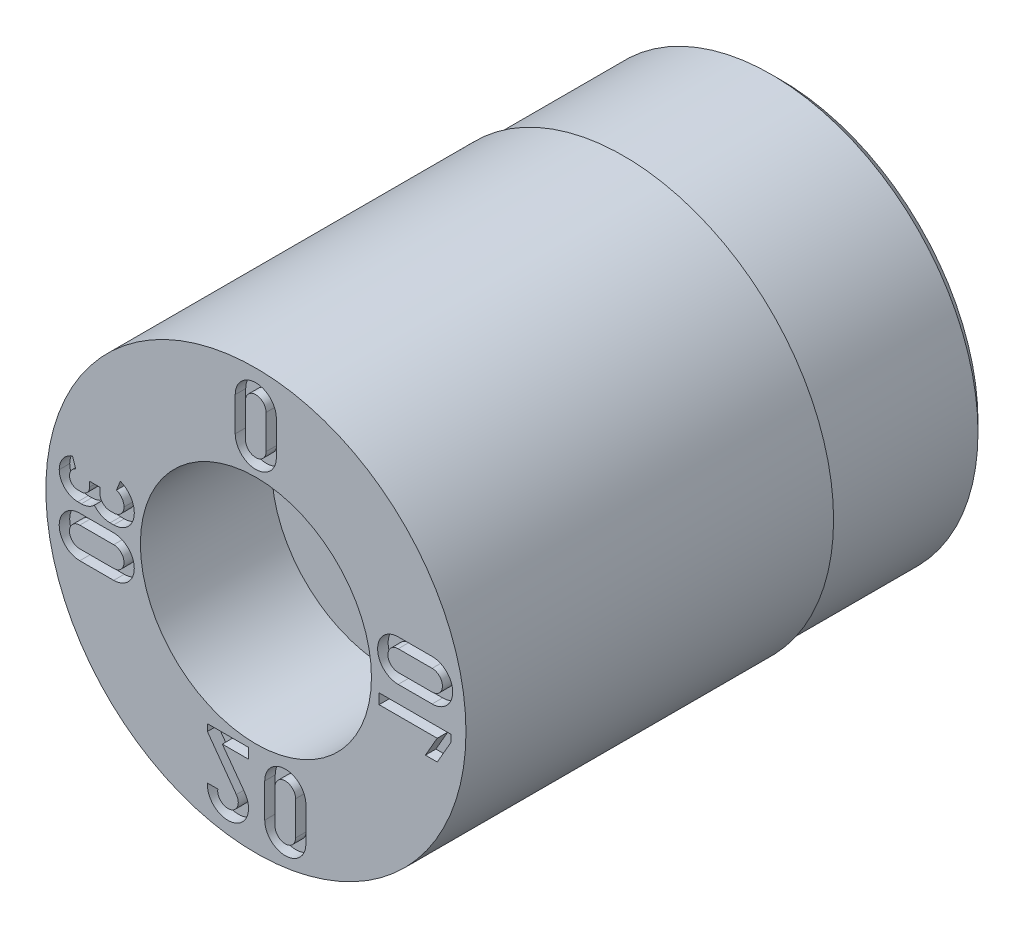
ISO-10303-21;
HEADER;
FILE_DESCRIPTION(('STEP AP214'),'2;1');
FILE_NAME('part.step','',(''),(''),'','','');
FILE_SCHEMA(('AUTOMOTIVE_DESIGN { 1 0 10303 214 1 1 1 1 }'));
ENDSEC;
DATA;
#1=APPLICATION_CONTEXT('core data for automotive mechanical design processes');
#2=APPLICATION_PROTOCOL_DEFINITION('international standard','automotive_design',2000,#1);
#3=PRODUCT_CONTEXT('',#1,'mechanical');
#4=PRODUCT('Part','Part','',(#3));
#5=PRODUCT_RELATED_PRODUCT_CATEGORY('part','',(#4));
#6=PRODUCT_DEFINITION_FORMATION('','',#4);
#7=PRODUCT_DEFINITION_CONTEXT('part definition',#1,'design');
#8=PRODUCT_DEFINITION('design','',#6,#7);
#9=PRODUCT_DEFINITION_SHAPE('','',#8);
#10=(LENGTH_UNIT() NAMED_UNIT(*) SI_UNIT(.MILLI.,.METRE.));
#11=(NAMED_UNIT(*) PLANE_ANGLE_UNIT() SI_UNIT($,.RADIAN.));
#12=(NAMED_UNIT(*) SI_UNIT($,.STERADIAN.) SOLID_ANGLE_UNIT());
#13=UNCERTAINTY_MEASURE_WITH_UNIT(LENGTH_MEASURE(1.E-05),#10,'distance_accuracy_value','');
#14=(GEOMETRIC_REPRESENTATION_CONTEXT(3) GLOBAL_UNCERTAINTY_ASSIGNED_CONTEXT((#13)) GLOBAL_UNIT_ASSIGNED_CONTEXT((#10,
#11,#12)) REPRESENTATION_CONTEXT('',''));
#15=CARTESIAN_POINT('',(0.,0.,0.));
#16=DIRECTION('',(0.,0.,1.));
#17=DIRECTION('',(1.,0.,0.));
#18=AXIS2_PLACEMENT_3D('',#15,#16,#17);
#19=CARTESIAN_POINT('',(0.,0.,3.79790950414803));
#20=DIRECTION('',(0.,0.,1.));
#21=DIRECTION('',(1.,0.,0.));
#22=AXIS2_PLACEMENT_3D('',#19,#20,#21);
#23=CYLINDRICAL_SURFACE('',#22,4.);
#24=CARTESIAN_POINT('',(0.,0.,0.));
#25=DIRECTION('',(0.,0.,1.));
#26=DIRECTION('',(1.,0.,0.));
#27=AXIS2_PLACEMENT_3D('',#24,#25,#26);
#28=CIRCLE('',#27,4.);
#29=CARTESIAN_POINT('',(4.,0.,0.));
#30=VERTEX_POINT('',#29);
#31=EDGE_CURVE('E11',#30,#30,#28,.T.);
#32=ORIENTED_EDGE('',*,*,#31,.F.);
#33=EDGE_LOOP('',(#32));
#34=FACE_BOUND('',#33,.T.);
#35=CARTESIAN_POINT('',(0.,0.,-7.));
#36=DIRECTION('',(0.,0.,-1.));
#37=DIRECTION('',(-1.,0.,0.));
#38=AXIS2_PLACEMENT_3D('',#35,#36,#37);
#39=CIRCLE('',#38,4.);
#40=CARTESIAN_POINT('',(-4.,0.,-7.));
#41=VERTEX_POINT('',#40);
#42=EDGE_CURVE('E37',#41,#41,#39,.T.);
#43=ORIENTED_EDGE('',*,*,#42,.F.);
#44=EDGE_LOOP('',(#43));
#45=FACE_BOUND('',#44,.T.);
#46=ADVANCED_FACE('F34',(#34,#45),#23,.T.);
#47=CARTESIAN_POINT('',(0.,0.,-10.));
#48=DIRECTION('',(0.,0.,1.));
#49=DIRECTION('',(1.,0.,0.));
#50=AXIS2_PLACEMENT_3D('',#47,#48,#49);
#51=CONICAL_SURFACE('',#50,3.7499999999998,0.785398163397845);
#52=CARTESIAN_POINT('',(0.,0.,-10.));
#53=DIRECTION('',(0.,0.,1.));
#54=DIRECTION('',(1.,0.,0.));
#55=AXIS2_PLACEMENT_3D('',#52,#53,#54);
#56=CIRCLE('',#55,3.7499999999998);
#57=CARTESIAN_POINT('',(3.7499999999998,0.,-10.));
#58=VERTEX_POINT('',#57);
#59=EDGE_CURVE('E1032',#58,#58,#56,.T.);
#60=ORIENTED_EDGE('',*,*,#59,.T.);
#61=EDGE_LOOP('',(#60));
#62=FACE_BOUND('',#61,.T.);
#63=CARTESIAN_POINT('',(0.,0.,-9.81499999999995));
#64=DIRECTION('',(0.,0.,1.));
#65=DIRECTION('',(1.,0.,0.));
#66=AXIS2_PLACEMENT_3D('',#63,#64,#65);
#67=CIRCLE('',#66,3.935);
#68=CARTESIAN_POINT('',(3.935,0.,-9.81499999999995));
#69=VERTEX_POINT('',#68);
#70=EDGE_CURVE('E1031',#69,#69,#67,.T.);
#71=ORIENTED_EDGE('',*,*,#70,.F.);
#72=EDGE_LOOP('',(#71));
#73=FACE_BOUND('',#72,.T.);
#74=ADVANCED_FACE('F1054',(#62,#73),#51,.T.);
#75=CARTESIAN_POINT('',(0.,4.,0.));
#76=DIRECTION('',(0.,0.,-1.));
#77=DIRECTION('',(-1.,0.,0.));
#78=AXIS2_PLACEMENT_3D('',#75,#76,#77);
#79=PLANE('',#78);
#80=DIRECTION('',(0.999999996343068,-8.55211335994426E-05,0.));
#81=VECTOR('',#80,1.);
#82=CARTESIAN_POINT('',(-2.70783340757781,-0.854595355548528,0.));
#83=LINE('',#82,#81);
#84=CARTESIAN_POINT('',(-3.35410056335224,-0.854540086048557,0.));
#85=VERTEX_POINT('',#84);
#86=CARTESIAN_POINT('',(-2.70783340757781,-0.854595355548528,0.));
#87=VERTEX_POINT('',#86);
#88=EDGE_CURVE('E522',#85,#87,#83,.T.);
#89=ORIENTED_EDGE('',*,*,#88,.F.);
#90=CARTESIAN_POINT('',(-3.3540670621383,-0.462809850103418,0.));
#91=DIRECTION('',(0.,0.,1.));
#92=DIRECTION('',(1.,0.,0.));
#93=AXIS2_PLACEMENT_3D('',#90,#91,#92);
#94=CIRCLE('',#93,0.391730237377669);
#95=CARTESIAN_POINT('',(-3.35403356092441,-0.0710796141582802,0.));
#96=VERTEX_POINT('',#95);
#97=EDGE_CURVE('E50',#96,#85,#94,.T.);
#98=ORIENTED_EDGE('',*,*,#97,.F.);
#99=DIRECTION('',(-0.999999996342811,8.55241324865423E-05,0.));
#100=VECTOR('',#99,1.);
#101=CARTESIAN_POINT('',(-3.35403356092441,-0.0710796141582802,0.));
#102=LINE('',#101,#100);
#103=CARTESIAN_POINT('',(-2.70778226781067,-0.0711348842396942,0.));
#104=VERTEX_POINT('',#103);
#105=EDGE_CURVE('E511',#104,#96,#102,.T.);
#106=ORIENTED_EDGE('',*,*,#105,.F.);
#107=CARTESIAN_POINT('',(-2.70780783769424,-0.462865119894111,0.));
#108=DIRECTION('',(0.,0.,1.));
#109=DIRECTION('',(1.,0.,0.));
#110=AXIS2_PLACEMENT_3D('',#107,#108,#109);
#111=CIRCLE('',#110,0.391730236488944);
#112=EDGE_CURVE('E525',#87,#104,#111,.T.);
#113=ORIENTED_EDGE('',*,*,#112,.F.);
#114=EDGE_LOOP('',(#89,#98,#106,#113));
#115=FACE_BOUND('',#114,.T.);
#116=DIRECTION('',(8.43544746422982E-05,-0.999999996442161,0.));
#117=VECTOR('',#116,1.);
#118=CARTESIAN_POINT('',(-0.394003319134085,3.36450114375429,0.));
#119=LINE('',#118,#117);
#120=CARTESIAN_POINT('',(-0.394003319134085,3.36450114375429,0.));
#121=VERTEX_POINT('',#120);
#122=CARTESIAN_POINT('',(-0.393948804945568,2.71824985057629,0.));
#123=VERTEX_POINT('',#122);
#124=EDGE_CURVE('E586',#121,#123,#119,.T.);
#125=ORIENTED_EDGE('',*,*,#124,.F.);
#126=CARTESIAN_POINT('',(-0.00227308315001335,3.36453418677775,0.));
#127=DIRECTION('',(0.,0.,1.));
#128=DIRECTION('',(1.,0.,0.));
#129=AXIS2_PLACEMENT_3D('',#126,#127,#128);
#130=CIRCLE('',#129,0.391730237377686);
#131=CARTESIAN_POINT('',(0.389457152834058,3.36456722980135,0.));
#132=VERTEX_POINT('',#131);
#133=EDGE_CURVE('E564',#132,#121,#130,.T.);
#134=ORIENTED_EDGE('',*,*,#133,.F.);
#135=DIRECTION('',(8.53192128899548E-05,0.999999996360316,0.));
#136=VECTOR('',#135,1.);
#137=CARTESIAN_POINT('',(0.389402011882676,2.71827726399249,0.));
#138=LINE('',#137,#136);
#139=CARTESIAN_POINT('',(0.389402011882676,2.71827726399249,0.));
#140=VERTEX_POINT('',#139);
#141=EDGE_CURVE('E575',#140,#132,#138,.T.);
#142=ORIENTED_EDGE('',*,*,#141,.F.);
#143=CARTESIAN_POINT('',(-0.00227339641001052,2.71826008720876,0.));
#144=DIRECTION('',(0.,0.,1.));
#145=DIRECTION('',(1.,0.,0.));
#146=AXIS2_PLACEMENT_3D('',#143,#144,#145);
#147=CIRCLE('',#146,0.391675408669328);
#148=EDGE_CURVE('E589',#123,#140,#147,.T.);
#149=ORIENTED_EDGE('',*,*,#148,.F.);
#150=EDGE_LOOP('',(#125,#134,#142,#149));
#151=FACE_BOUND('',#150,.T.);
#152=DIRECTION('',(-8.43514763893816E-05,0.999999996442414,0.));
#153=VECTOR('',#152,1.);
#154=CARTESIAN_POINT('',(-0.140181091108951,-2.5213803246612,0.));
#155=LINE('',#154,#153);
#156=CARTESIAN_POINT('',(-0.140181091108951,-2.5213803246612,0.));
#157=VERTEX_POINT('',#156);
#158=CARTESIAN_POINT('',(-0.140197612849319,-2.32551249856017,0.));
#159=VERTEX_POINT('',#158);
#160=EDGE_CURVE('E633',#157,#159,#155,.T.);
#161=ORIENTED_EDGE('',*,*,#160,.F.);
#162=DIRECTION('',(0.999999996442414,8.43514759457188E-05,0.));
#163=VECTOR('',#162,1.);
#164=CARTESIAN_POINT('',(-0.639603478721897,-2.52142245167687,0.));
#165=LINE('',#164,#163);
#166=CARTESIAN_POINT('',(-0.639603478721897,-2.52142245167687,0.));
#167=VERTEX_POINT('',#166);
#168=EDGE_CURVE('E596',#167,#157,#165,.T.);
#169=ORIENTED_EDGE('',*,*,#168,.F.);
#170=DIRECTION('',(-0.589622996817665,0.80767860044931,0.));
#171=VECTOR('',#170,1.);
#172=CARTESIAN_POINT('',(-0.213623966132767,-3.10493859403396,0.));
#173=LINE('',#172,#171);
#174=CARTESIAN_POINT('',(-0.213623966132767,-3.10493859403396,0.));
#175=VERTEX_POINT('',#174);
#176=EDGE_CURVE('E607',#175,#167,#173,.T.);
#177=ORIENTED_EDGE('',*,*,#176,.F.);
#178=CARTESIAN_POINT('',(-0.531619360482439,-3.33387831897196,0.));
#179=DIRECTION('',(0.,0.,1.));
#180=DIRECTION('',(1.,0.,0.));
#181=AXIS2_PLACEMENT_3D('',#178,#179,#180);
#182=CIRCLE('',#181,0.391834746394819);
#183=CARTESIAN_POINT('',(-0.922369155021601,-3.30473957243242,0.));
#184=VERTEX_POINT('',#183);
#185=EDGE_CURVE('E651',#184,#175,#182,.T.);
#186=ORIENTED_EDGE('',*,*,#185,.F.);
#187=DIRECTION('',(-0.999999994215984,-0.000107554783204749,0.));
#188=VECTOR('',#187,1.);
#189=CARTESIAN_POINT('',(-0.725390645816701,-3.30471838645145,0.));
#190=LINE('',#189,#188);
#191=CARTESIAN_POINT('',(-0.725390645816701,-3.30471838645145,0.));
#192=VERTEX_POINT('',#191);
#193=EDGE_CURVE('E648',#192,#184,#190,.T.);
#194=ORIENTED_EDGE('',*,*,#193,.F.);
#195=CARTESIAN_POINT('',(-0.53171835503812,-3.33409330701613,0.));
#196=DIRECTION('',(0.,0.,-1.));
#197=DIRECTION('',(1.,0.,0.));
#198=AXIS2_PLACEMENT_3D('',#195,#196,#197);
#199=CIRCLE('',#198,0.195887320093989);
#200=CARTESIAN_POINT('',(-0.372780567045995,-3.21959168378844,0.));
#201=VERTEX_POINT('',#200);
#202=EDGE_CURVE('E645',#201,#192,#199,.T.);
#203=ORIENTED_EDGE('',*,*,#202,.F.);
#204=DIRECTION('',(0.584527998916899,-0.811373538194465,0.));
#205=VECTOR('',#204,1.);
#206=CARTESIAN_POINT('',(-0.923537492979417,-2.45509520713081,0.));
#207=LINE('',#206,#205);
#208=CARTESIAN_POINT('',(-0.923537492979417,-2.45509520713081,0.));
#209=VERTEX_POINT('',#208);
#210=EDGE_CURVE('E642',#209,#201,#207,.T.);
#211=ORIENTED_EDGE('',*,*,#210,.F.);
#212=DIRECTION('',(8.43514743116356E-05,-0.999999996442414,0.));
#213=VECTOR('',#212,1.);
#214=CARTESIAN_POINT('',(-0.923548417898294,-2.32557857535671,0.));
#215=LINE('',#214,#213);
#216=CARTESIAN_POINT('',(-0.923548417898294,-2.32557857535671,0.));
#217=VERTEX_POINT('',#216);
#218=EDGE_CURVE('E639',#217,#209,#215,.T.);
#219=ORIENTED_EDGE('',*,*,#218,.F.);
#220=DIRECTION('',(-0.999999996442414,-8.43514755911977E-05,0.));
#221=VECTOR('',#220,1.);
#222=CARTESIAN_POINT('',(-0.140197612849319,-2.32551249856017,0.));
#223=LINE('',#222,#221);
#224=EDGE_CURVE('E636',#159,#217,#223,.T.);
#225=ORIENTED_EDGE('',*,*,#224,.F.);
#226=EDGE_LOOP('',(#161,#169,#177,#186,#194,#203,#211,#219,#225));
#227=FACE_BOUND('',#226,.T.);
#228=DIRECTION('',(8.48997848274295E-05,-0.999999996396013,0.));
#229=VECTOR('',#228,1.);
#230=CARTESIAN_POINT('',(2.34584756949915,-0.378657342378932,0.));
#231=LINE('',#230,#229);
#232=CARTESIAN_POINT('',(2.34583094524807,-0.182847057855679,0.));
#233=VERTEX_POINT('',#232);
#234=CARTESIAN_POINT('',(2.34584756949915,-0.378657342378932,0.));
#235=VERTEX_POINT('',#234);
#236=EDGE_CURVE('E699',#233,#235,#231,.T.);
#237=ORIENTED_EDGE('',*,*,#236,.F.);
#238=DIRECTION('',(-0.999999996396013,-8.48997846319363E-05,0.));
#239=VECTOR('',#238,1.);
#240=CARTESIAN_POINT('',(2.34583094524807,-0.182847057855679,0.));
#241=LINE('',#240,#239);
#242=CARTESIAN_POINT('',(3.71666743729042,-0.18273067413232,0.));
#243=VERTEX_POINT('',#242);
#244=EDGE_CURVE('E658',#243,#233,#241,.T.);
#245=ORIENTED_EDGE('',*,*,#244,.F.);
#246=DIRECTION('',(-8.48997827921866E-05,0.999999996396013,0.));
#247=VECTOR('',#246,1.);
#248=CARTESIAN_POINT('',(3.71666743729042,-0.18273067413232,0.));
#249=LINE('',#248,#247);
#250=CARTESIAN_POINT('',(3.71667838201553,-0.311644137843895,0.));
#251=VERTEX_POINT('',#250);
#252=EDGE_CURVE('E679',#251,#243,#249,.T.);
#253=ORIENTED_EDGE('',*,*,#252,.F.);
#254=DIRECTION('',(0.498418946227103,0.866936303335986,0.));
#255=VECTOR('',#254,1.);
#256=CARTESIAN_POINT('',(3.71667838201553,-0.311644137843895,0.));
#257=LINE('',#256,#255);
#258=CARTESIAN_POINT('',(3.45302320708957,-0.770238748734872,0.));
#259=VERTEX_POINT('',#258);
#260=EDGE_CURVE('E711',#259,#251,#257,.T.);
#261=ORIENTED_EDGE('',*,*,#260,.F.);
#262=DIRECTION('',(0.999999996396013,8.48997839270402E-05,0.));
#263=VECTOR('',#262,1.);
#264=CARTESIAN_POINT('',(3.45302320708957,-0.770238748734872,0.));
#265=LINE('',#264,#263);
#266=CARTESIAN_POINT('',(3.22716418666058,-0.770257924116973,0.));
#267=VERTEX_POINT('',#266);
#268=EDGE_CURVE('E708',#267,#259,#265,.T.);
#269=ORIENTED_EDGE('',*,*,#268,.F.);
#270=DIRECTION('',(-0.498285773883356,-0.867012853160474,0.));
#271=VECTOR('',#270,1.);
#272=CARTESIAN_POINT('',(3.22716418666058,-0.770257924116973,0.));
#273=LINE('',#272,#271);
#274=CARTESIAN_POINT('',(3.45227711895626,-0.378563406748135,0.));
#275=VERTEX_POINT('',#274);
#276=EDGE_CURVE('E705',#275,#267,#273,.T.);
#277=ORIENTED_EDGE('',*,*,#276,.F.);
#278=DIRECTION('',(0.999999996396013,8.48997846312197E-05,0.));
#279=VECTOR('',#278,1.);
#280=CARTESIAN_POINT('',(3.45227711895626,-0.378563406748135,0.));
#281=LINE('',#280,#279);
#282=EDGE_CURVE('E702',#235,#275,#281,.T.);
#283=ORIENTED_EDGE('',*,*,#282,.F.);
#284=EDGE_LOOP('',(#237,#245,#253,#261,#269,#277,#283));
#285=FACE_BOUND('',#284,.T.);
#286=DIRECTION('',(-0.999999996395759,-8.4902783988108E-05,0.));
#287=VECTOR('',#286,1.);
#288=CARTESIAN_POINT('',(3.35566898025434,0.92170680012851,0.));
#289=LINE('',#288,#287);
#290=CARTESIAN_POINT('',(3.35566898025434,0.92170680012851,0.));
#291=VERTEX_POINT('',#290);
#292=CARTESIAN_POINT('',(2.70941768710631,0.921651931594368,0.));
#293=VERTEX_POINT('',#292);
#294=EDGE_CURVE('E779',#291,#293,#289,.T.);
#295=ORIENTED_EDGE('',*,*,#294,.F.);
#296=CARTESIAN_POINT('',(3.35570223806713,0.529976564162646,0.));
#297=DIRECTION('',(0.,0.,1.));
#298=DIRECTION('',(1.,0.,0.));
#299=AXIS2_PLACEMENT_3D('',#296,#297,#298);
#300=CIRCLE('',#299,0.391730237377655);
#301=CARTESIAN_POINT('',(3.35573549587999,0.138246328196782,0.));
#302=VERTEX_POINT('',#301);
#303=EDGE_CURVE('E757',#302,#291,#300,.T.);
#304=ORIENTED_EDGE('',*,*,#303,.F.);
#305=DIRECTION('',(0.999999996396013,8.48997850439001E-05,0.));
#306=VECTOR('',#305,1.);
#307=CARTESIAN_POINT('',(2.70946834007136,0.138191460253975,0.));
#308=LINE('',#307,#306);
#309=CARTESIAN_POINT('',(2.70946834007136,0.138191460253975,0.));
#310=VERTEX_POINT('',#309);
#311=EDGE_CURVE('E768',#310,#302,#308,.T.);
#312=ORIENTED_EDGE('',*,*,#311,.F.);
#313=CARTESIAN_POINT('',(2.70945094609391,0.529921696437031,0.));
#314=DIRECTION('',(0.,0.,1.));
#315=DIRECTION('',(1.,0.,0.));
#316=AXIS2_PLACEMENT_3D('',#313,#314,#315);
#317=CIRCLE('',#316,0.391730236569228);
#318=EDGE_CURVE('E782',#293,#310,#317,.T.);
#319=ORIENTED_EDGE('',*,*,#318,.F.);
#320=EDGE_LOOP('',(#295,#304,#312,#319));
#321=FACE_BOUND('',#320,.T.);
#322=DIRECTION('',(-0.999999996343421,8.55170029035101E-05,0.));
#323=VECTOR('',#322,1.);
#324=CARTESIAN_POINT('',(-2.70730818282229,0.255520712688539,0.));
#325=LINE('',#324,#323);
#326=CARTESIAN_POINT('',(-2.70730818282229,0.255520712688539,0.));
#327=VERTEX_POINT('',#326);
#328=CARTESIAN_POINT('',(-2.77585173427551,0.255526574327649,0.));
#329=VERTEX_POINT('',#328);
#330=EDGE_CURVE('E862',#327,#329,#325,.T.);
#331=ORIENTED_EDGE('',*,*,#330,.F.);
#332=CARTESIAN_POINT('',(-2.70729143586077,0.451352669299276,0.));
#333=DIRECTION('',(0.,0.,-1.));
#334=DIRECTION('',(1.,0.,0.));
#335=AXIS2_PLACEMENT_3D('',#332,#333,#334);
#336=CIRCLE('',#335,0.195831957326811);
#337=CARTESIAN_POINT('',(-2.51145947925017,0.451335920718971,0.));
#338=VERTEX_POINT('',#337);
#339=EDGE_CURVE('E789',#338,#327,#336,.T.);
#340=ORIENTED_EDGE('',*,*,#339,.F.);
#341=CARTESIAN_POINT('',(-2.73671254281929,0.451355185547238,0.));
#342=DIRECTION('',(0.,0.,-1.));
#343=DIRECTION('',(1.,0.,0.));
#344=AXIS2_PLACEMENT_3D('',#341,#342,#343);
#345=CIRCLE('',#344,0.225253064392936);
#346=CARTESIAN_POINT('',(-2.65401933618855,0.660880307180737,0.));
#347=VERTEX_POINT('',#346);
#348=EDGE_CURVE('E800',#347,#338,#345,.T.);
#349=ORIENTED_EDGE('',*,*,#348,.F.);
#350=DIRECTION('',(-0.367087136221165,-0.930186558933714,0.));
#351=VECTOR('',#350,1.);
#352=CARTESIAN_POINT('',(-2.58214902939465,0.842997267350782,0.));
#353=LINE('',#352,#351);
#354=CARTESIAN_POINT('',(-2.58214902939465,0.842997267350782,0.));
#355=VERTEX_POINT('',#354);
#356=EDGE_CURVE('E916',#355,#347,#353,.T.);
#357=ORIENTED_EDGE('',*,*,#356,.F.);
#358=CARTESIAN_POINT('',(-2.73680854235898,0.451263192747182,0.));
#359=DIRECTION('',(0.,0.,1.));
#360=DIRECTION('',(1.,0.,0.));
#361=AXIS2_PLACEMENT_3D('',#358,#359,#360);
#362=CIRCLE('',#361,0.421159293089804);
#363=CARTESIAN_POINT('',(-2.31564924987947,0.451285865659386,0.));
#364=VERTEX_POINT('',#363);
#365=EDGE_CURVE('E913',#364,#355,#362,.T.);
#366=ORIENTED_EDGE('',*,*,#365,.F.);
#367=CARTESIAN_POINT('',(-2.70725841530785,0.45126478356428,0.));
#368=DIRECTION('',(0.,0.,1.));
#369=DIRECTION('',(1.,0.,0.));
#370=AXIS2_PLACEMENT_3D('',#367,#368,#369);
#371=CIRCLE('',#370,0.391609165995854);
#372=CARTESIAN_POINT('',(-2.70729180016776,0.0596556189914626,0.));
#373=VERTEX_POINT('',#372);
#374=EDGE_CURVE('E910',#373,#364,#371,.T.);
#375=ORIENTED_EDGE('',*,*,#374,.F.);
#376=DIRECTION('',(0.99999999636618,-8.525045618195E-05,0.));
#377=VECTOR('',#376,1.);
#378=CARTESIAN_POINT('',(-2.7758604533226,0.0596614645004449,0.));
#379=LINE('',#378,#377);
#380=CARTESIAN_POINT('',(-2.7758604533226,0.0596614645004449,0.));
#381=VERTEX_POINT('',#380);
#382=EDGE_CURVE('E907',#381,#373,#379,.T.);
#383=ORIENTED_EDGE('',*,*,#382,.F.);
#384=CARTESIAN_POINT('',(-2.7759212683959,0.451172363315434,0.));
#385=DIRECTION('',(0.,0.,1.));
#386=DIRECTION('',(1.,0.,0.));
#387=AXIS2_PLACEMENT_3D('',#384,#385,#386);
#388=CIRCLE('',#387,0.391510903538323);
#389=CARTESIAN_POINT('',(-3.07661727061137,0.200448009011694,0.));
#390=VERTEX_POINT('',#389);
#391=EDGE_CURVE('E904',#390,#381,#388,.T.);
#392=ORIENTED_EDGE('',*,*,#391,.F.);
#393=CARTESIAN_POINT('',(-3.32414606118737,0.451215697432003,0.));
#394=DIRECTION('',(0.,0.,1.));
#395=DIRECTION('',(1.,0.,0.));
#396=AXIS2_PLACEMENT_3D('',#393,#394,#395);
#397=CIRCLE('',#396,0.352356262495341);
#398=CARTESIAN_POINT('',(-3.32417633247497,0.0988594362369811,0.));
#399=VERTEX_POINT('',#398);
#400=EDGE_CURVE('E901',#399,#390,#397,.T.);
#401=ORIENTED_EDGE('',*,*,#400,.F.);
#402=DIRECTION('',(0.999999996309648,-8.59110265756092E-05,0.));
#403=VECTOR('',#402,1.);
#404=CARTESIAN_POINT('',(-3.39269092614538,0.0988653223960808,0.));
#405=LINE('',#404,#403);
#406=CARTESIAN_POINT('',(-3.39269092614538,0.0988653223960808,0.));
#407=VERTEX_POINT('',#406);
#408=EDGE_CURVE('E898',#407,#399,#405,.T.);
#409=ORIENTED_EDGE('',*,*,#408,.F.);
#410=CARTESIAN_POINT('',(-3.39271522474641,0.45133912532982,0.));
#411=DIRECTION('',(0.,0.,1.));
#412=DIRECTION('',(1.,0.,0.));
#413=AXIS2_PLACEMENT_3D('',#410,#411,#412);
#414=CIRCLE('',#413,0.352473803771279);
#415=CARTESIAN_POINT('',(-3.74518901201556,0.451446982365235,0.));
#416=VERTEX_POINT('',#415);
#417=EDGE_CURVE('E895',#416,#407,#414,.T.);
#418=ORIENTED_EDGE('',*,*,#417,.F.);
#419=CARTESIAN_POINT('',(-3.37300280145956,0.451333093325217,0.));
#420=DIRECTION('',(0.,0.,1.));
#421=DIRECTION('',(1.,0.,0.));
#422=AXIS2_PLACEMENT_3D('',#419,#420,#421);
#423=CIRCLE('',#422,0.372186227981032);
#424=CARTESIAN_POINT('',(-3.49218058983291,0.803922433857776,0.));
#425=VERTEX_POINT('',#424);
#426=EDGE_CURVE('E892',#425,#416,#423,.T.);
#427=ORIENTED_EDGE('',*,*,#426,.F.);
#428=DIRECTION('',(-0.319923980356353,0.94744321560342,0.));
#429=VECTOR('',#428,1.);
#430=CARTESIAN_POINT('',(-3.42952099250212,0.618358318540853,0.));
#431=LINE('',#430,#429);
#432=CARTESIAN_POINT('',(-3.42952099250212,0.618358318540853,0.));
#433=VERTEX_POINT('',#432);
#434=EDGE_CURVE('E889',#433,#425,#431,.T.);
#435=ORIENTED_EDGE('',*,*,#434,.F.);
#436=CARTESIAN_POINT('',(-3.37333178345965,0.451552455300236,0.));
#437=DIRECTION('',(0.,0.,-1.));
#438=DIRECTION('',(1.,0.,0.));
#439=AXIS2_PLACEMENT_3D('',#436,#437,#438);
#440=CIRCLE('',#439,0.176015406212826);
#441=CARTESIAN_POINT('',(-3.54934712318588,0.45139946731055,0.));
#442=VERTEX_POINT('',#441);
#443=EDGE_CURVE('E886',#442,#433,#440,.T.);
#444=ORIENTED_EDGE('',*,*,#443,.F.);
#445=CARTESIAN_POINT('',(-3.39254177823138,0.451535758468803,0.));
#446=DIRECTION('',(0.,0.,-1.));
#447=DIRECTION('',(1.,0.,0.));
#448=AXIS2_PLACEMENT_3D('',#445,#446,#447);
#449=CIRCLE('',#448,0.156805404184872);
#450=CARTESIAN_POINT('',(-3.39269364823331,0.294730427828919,0.));
#451=VERTEX_POINT('',#450);
#452=EDGE_CURVE('E883',#451,#442,#449,.T.);
#453=ORIENTED_EDGE('',*,*,#452,.F.);
#454=DIRECTION('',(-0.999999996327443,8.57036442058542E-05,0.));
#455=VECTOR('',#454,1.);
#456=CARTESIAN_POINT('',(-3.32415958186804,0.294724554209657,0.));
#457=LINE('',#456,#455);
#458=CARTESIAN_POINT('',(-3.32415958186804,0.294724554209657,0.));
#459=VERTEX_POINT('',#458);
#460=EDGE_CURVE('E880',#459,#451,#457,.T.);
#461=ORIENTED_EDGE('',*,*,#460,.F.);
#462=CARTESIAN_POINT('',(-3.32414615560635,0.451383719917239,0.));
#463=DIRECTION('',(0.,0.,-1.));
#464=DIRECTION('',(1.,0.,0.));
#465=AXIS2_PLACEMENT_3D('',#462,#463,#464);
#466=CIRCLE('',#465,0.156659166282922);
#467=CARTESIAN_POINT('',(-3.16748698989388,0.451370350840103,0.));
#468=VERTEX_POINT('',#467);
#469=EDGE_CURVE('E877',#468,#459,#466,.T.);
#470=ORIENTED_EDGE('',*,*,#469,.F.);
#471=DIRECTION('',(-8.55211336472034E-05,-0.999999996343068,0.));
#472=VECTOR('',#471,1.);
#473=CARTESIAN_POINT('',(-3.1674786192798,0.549248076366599,0.));
#474=LINE('',#473,#472);
#475=CARTESIAN_POINT('',(-3.1674786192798,0.549248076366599,0.));
#476=VERTEX_POINT('',#475);
#477=EDGE_CURVE('E874',#476,#468,#474,.T.);
#478=ORIENTED_EDGE('',*,*,#477,.F.);
#479=DIRECTION('',(-0.999999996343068,8.55211334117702E-05,0.));
#480=VECTOR('',#479,1.);
#481=CARTESIAN_POINT('',(-2.97161350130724,0.549231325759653,0.));
#482=LINE('',#481,#480);
#483=CARTESIAN_POINT('',(-2.97161350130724,0.549231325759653,0.));
#484=VERTEX_POINT('',#483);
#485=EDGE_CURVE('E871',#484,#476,#482,.T.);
#486=ORIENTED_EDGE('',*,*,#485,.F.);
#487=DIRECTION('',(8.54959125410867E-05,0.999999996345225,0.));
#488=VECTOR('',#487,1.);
#489=CARTESIAN_POINT('',(-2.97162187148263,0.451329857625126,0.));
#490=LINE('',#489,#488);
#491=CARTESIAN_POINT('',(-2.97162187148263,0.451329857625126,0.));
#492=VERTEX_POINT('',#491);
#493=EDGE_CURVE('E868',#492,#484,#490,.T.);
#494=ORIENTED_EDGE('',*,*,#493,.F.);
#495=CARTESIAN_POINT('',(-2.7758353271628,0.451313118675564,0.));
#496=DIRECTION('',(0.,0.,-1.));
#497=DIRECTION('',(1.,0.,0.));
#498=AXIS2_PLACEMENT_3D('',#495,#496,#497);
#499=CIRCLE('',#498,0.195786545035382);
#500=EDGE_CURVE('E865',#329,#492,#499,.T.);
#501=ORIENTED_EDGE('',*,*,#500,.F.);
#502=EDGE_LOOP('',(#331,#340,#349,#357,#366,#375,#383,#392,#401,#409,#418,#427,#435,#444,#453,
#461,#470,#478,#486,#494,#501));
#503=FACE_BOUND('',#502,.T.);
#504=DIRECTION('',(8.53270660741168E-05,0.999999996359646,0.));
#505=VECTOR('',#504,1.);
#506=CARTESIAN_POINT('',(0.95155863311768,-3.37112856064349,0.));
#507=LINE('',#506,#505);
#508=CARTESIAN_POINT('',(0.95155863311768,-3.37112856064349,0.));
#509=VERTEX_POINT('',#508);
#510=CARTESIAN_POINT('',(0.951613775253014,-2.72488420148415,0.));
#511=VERTEX_POINT('',#510);
#512=EDGE_CURVE('E1012',#509,#511,#507,.T.);
#513=ORIENTED_EDGE('',*,*,#512,.F.);
#514=CARTESIAN_POINT('',(0.55982839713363,-3.37116160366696,0.));
#515=DIRECTION('',(0.,0.,1.));
#516=DIRECTION('',(1.,0.,0.));
#517=AXIS2_PLACEMENT_3D('',#514,#515,#516);
#518=CIRCLE('',#517,0.391730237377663);
#519=CARTESIAN_POINT('',(0.168098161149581,-3.37119464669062,0.));
#520=VERTEX_POINT('',#519);
#521=EDGE_CURVE('E990',#520,#509,#518,.T.);
#522=ORIENTED_EDGE('',*,*,#521,.F.);
#523=DIRECTION('',(8.43514759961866E-05,-0.999999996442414,0.));
#524=VECTOR('',#523,1.);
#525=CARTESIAN_POINT('',(0.168043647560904,-2.72492749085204,0.));
#526=LINE('',#525,#524);
#527=CARTESIAN_POINT('',(0.168043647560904,-2.72492749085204,0.));
#528=VERTEX_POINT('',#527);
#529=EDGE_CURVE('E1001',#528,#520,#526,.T.);
#530=ORIENTED_EDGE('',*,*,#529,.F.);
#531=CARTESIAN_POINT('',(0.559828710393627,-2.72488750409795,0.));
#532=DIRECTION('',(0.,0.,1.));
#533=DIRECTION('',(1.,0.,0.));
#534=AXIS2_PLACEMENT_3D('',#531,#532,#533);
#535=CIRCLE('',#534,0.391785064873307);
#536=EDGE_CURVE('E1015',#511,#528,#535,.T.);
#537=ORIENTED_EDGE('',*,*,#536,.F.);
#538=EDGE_LOOP('',(#513,#522,#530,#537));
#539=FACE_BOUND('',#538,.T.);
#540=CARTESIAN_POINT('',(0.,0.,0.));
#541=DIRECTION('',(0.,0.,1.));
#542=DIRECTION('',(1.,0.,0.));
#543=AXIS2_PLACEMENT_3D('',#540,#541,#542);
#544=CIRCLE('',#543,2.2);
#545=CARTESIAN_POINT('',(2.2,0.,0.));
#546=VERTEX_POINT('',#545);
#547=EDGE_CURVE('E42',#546,#546,#544,.T.);
#548=ORIENTED_EDGE('',*,*,#547,.F.);
#549=EDGE_LOOP('',(#548));
#550=FACE_BOUND('',#549,.T.);
#551=ORIENTED_EDGE('',*,*,#31,.T.);
#552=EDGE_LOOP('',(#551));
#553=FACE_BOUND('',#552,.T.);
#554=ADVANCED_FACE('F1059',(#115,#151,#227,#285,#321,#503,#539,#550,#553),#79,.F.);
#555=CARTESIAN_POINT('',(0.,0.,3.79790950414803));
#556=DIRECTION('',(0.,0.,1.));
#557=DIRECTION('',(1.,0.,0.));
#558=AXIS2_PLACEMENT_3D('',#555,#556,#557);
#559=CYLINDRICAL_SURFACE('',#558,2.2);
#560=CARTESIAN_POINT('',(0.,0.,-2.5));
#561=DIRECTION('',(0.,0.,1.));
#562=DIRECTION('',(1.,0.,0.));
#563=AXIS2_PLACEMENT_3D('',#560,#561,#562);
#564=CIRCLE('',#563,2.2);
#565=CARTESIAN_POINT('',(2.2,0.,-2.5));
#566=VERTEX_POINT('',#565);
#567=EDGE_CURVE('E1041',#566,#566,#564,.T.);
#568=ORIENTED_EDGE('',*,*,#567,.F.);
#569=EDGE_LOOP('',(#568));
#570=FACE_BOUND('',#569,.T.);
#571=ORIENTED_EDGE('',*,*,#547,.T.);
#572=EDGE_LOOP('',(#571));
#573=FACE_BOUND('',#572,.T.);
#574=ADVANCED_FACE('F1065',(#570,#573),#559,.F.);
#575=CARTESIAN_POINT('',(0.,2.2,-2.5));
#576=DIRECTION('',(0.,0.,-1.));
#577=DIRECTION('',(-1.,0.,0.));
#578=AXIS2_PLACEMENT_3D('',#575,#576,#577);
#579=PLANE('',#578);
#580=CARTESIAN_POINT('',(0.,0.,-2.5));
#581=DIRECTION('',(0.,0.,1.));
#582=DIRECTION('',(1.,0.,0.));
#583=AXIS2_PLACEMENT_3D('',#580,#581,#582);
#584=CIRCLE('',#583,1.15);
#585=CARTESIAN_POINT('',(1.15,0.,-2.5));
#586=VERTEX_POINT('',#585);
#587=EDGE_CURVE('E1038',#586,#586,#584,.T.);
#588=ORIENTED_EDGE('',*,*,#587,.F.);
#589=EDGE_LOOP('',(#588));
#590=FACE_BOUND('',#589,.T.);
#591=ORIENTED_EDGE('',*,*,#567,.T.);
#592=EDGE_LOOP('',(#591));
#593=FACE_BOUND('',#592,.T.);
#594=ADVANCED_FACE('F1072',(#590,#593),#579,.F.);
#595=CARTESIAN_POINT('',(0.,0.,3.79790950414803));
#596=DIRECTION('',(0.,0.,1.));
#597=DIRECTION('',(1.,0.,0.));
#598=AXIS2_PLACEMENT_3D('',#595,#596,#597);
#599=CYLINDRICAL_SURFACE('',#598,1.15);
#600=CARTESIAN_POINT('',(0.,0.,-10.));
#601=DIRECTION('',(0.,0.,1.));
#602=DIRECTION('',(1.,0.,0.));
#603=AXIS2_PLACEMENT_3D('',#600,#601,#602);
#604=CIRCLE('',#603,1.15);
#605=CARTESIAN_POINT('',(1.15,0.,-10.));
#606=VERTEX_POINT('',#605);
#607=EDGE_CURVE('E1035',#606,#606,#604,.T.);
#608=ORIENTED_EDGE('',*,*,#607,.F.);
#609=EDGE_LOOP('',(#608));
#610=FACE_BOUND('',#609,.T.);
#611=ORIENTED_EDGE('',*,*,#587,.T.);
#612=EDGE_LOOP('',(#611));
#613=FACE_BOUND('',#612,.T.);
#614=ADVANCED_FACE('F1223',(#610,#613),#599,.F.);
#615=CARTESIAN_POINT('',(0.,1.15,-10.));
#616=DIRECTION('',(0.,0.,1.));
#617=DIRECTION('',(1.,0.,0.));
#618=AXIS2_PLACEMENT_3D('',#615,#616,#617);
#619=PLANE('',#618);
#620=ORIENTED_EDGE('',*,*,#59,.F.);
#621=EDGE_LOOP('',(#620));
#622=FACE_BOUND('',#621,.T.);
#623=ORIENTED_EDGE('',*,*,#607,.T.);
#624=EDGE_LOOP('',(#623));
#625=FACE_BOUND('',#624,.T.);
#626=ADVANCED_FACE('F1218',(#622,#625),#619,.F.);
#627=CARTESIAN_POINT('',(0.,4.935,-7.));
#628=DIRECTION('',(0.,0.,-1.));
#629=DIRECTION('',(-1.,0.,0.));
#630=AXIS2_PLACEMENT_3D('',#627,#628,#629);
#631=PLANE('',#630);
#632=CARTESIAN_POINT('',(0.,0.,-7.));
#633=DIRECTION('',(0.,0.,1.));
#634=DIRECTION('',(1.,0.,0.));
#635=AXIS2_PLACEMENT_3D('',#632,#633,#634);
#636=CIRCLE('',#635,3.935);
#637=CARTESIAN_POINT('',(3.935,0.,-7.));
#638=VERTEX_POINT('',#637);
#639=EDGE_CURVE('E1022',#638,#638,#636,.T.);
#640=ORIENTED_EDGE('',*,*,#639,.T.);
#641=EDGE_LOOP('',(#640));
#642=FACE_BOUND('',#641,.T.);
#643=ORIENTED_EDGE('',*,*,#42,.T.);
#644=EDGE_LOOP('',(#643));
#645=FACE_BOUND('',#644,.T.);
#646=ADVANCED_FACE('F1051',(#642,#645),#631,.T.);
#647=CARTESIAN_POINT('',(0.,0.,0.));
#648=DIRECTION('',(0.,0.,1.));
#649=DIRECTION('',(1.,0.,0.));
#650=AXIS2_PLACEMENT_3D('',#647,#648,#649);
#651=CYLINDRICAL_SURFACE('',#650,3.935);
#652=ORIENTED_EDGE('',*,*,#639,.F.);
#653=EDGE_LOOP('',(#652));
#654=FACE_BOUND('',#653,.T.);
#655=ORIENTED_EDGE('',*,*,#70,.T.);
#656=EDGE_LOOP('',(#655));
#657=FACE_BOUND('',#656,.T.);
#658=ADVANCED_FACE('F1213',(#654,#657),#651,.T.);
#659=CARTESIAN_POINT('',(0.55982839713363,-3.37116160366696,-0.2));
#660=DIRECTION('',(0.,0.,1.));
#661=DIRECTION('',(1.,0.,0.));
#662=AXIS2_PLACEMENT_3D('',#659,#660,#661);
#663=CYLINDRICAL_SURFACE('',#662,0.391730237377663);
#664=ORIENTED_EDGE('',*,*,#521,.T.);
#665=DIRECTION('',(0.,0.,1.));
#666=VECTOR('',#665,1.);
#667=CARTESIAN_POINT('',(0.95155863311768,-3.37112856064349,-0.2));
#668=LINE('',#667,#666);
#669=CARTESIAN_POINT('',(0.95155863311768,-3.37112856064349,-0.2));
#670=VERTEX_POINT('',#669);
#671=EDGE_CURVE('E1010',#670,#509,#668,.T.);
#672=ORIENTED_EDGE('',*,*,#671,.F.);
#673=CARTESIAN_POINT('',(0.55982839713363,-3.37116160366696,-0.2));
#674=DIRECTION('',(0.,0.,1.));
#675=DIRECTION('',(1.,0.,0.));
#676=AXIS2_PLACEMENT_3D('',#673,#674,#675);
#677=CIRCLE('',#676,0.391730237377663);
#678=CARTESIAN_POINT('',(0.168098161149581,-3.37119464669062,-0.2));
#679=VERTEX_POINT('',#678);
#680=EDGE_CURVE('E997',#679,#670,#677,.T.);
#681=ORIENTED_EDGE('',*,*,#680,.F.);
#682=DIRECTION('',(0.,0.,1.));
#683=VECTOR('',#682,1.);
#684=CARTESIAN_POINT('',(0.168098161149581,-3.37119464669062,-0.2));
#685=LINE('',#684,#683);
#686=EDGE_CURVE('E1020',#679,#520,#685,.T.);
#687=ORIENTED_EDGE('',*,*,#686,.T.);
#688=EDGE_LOOP('',(#664,#672,#681,#687));
#689=FACE_BOUND('',#688,.T.);
#690=ADVANCED_FACE('F1185',(#689),#663,.F.);
#691=CARTESIAN_POINT('',(0.168043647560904,-2.72492749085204,-0.2));
#692=DIRECTION('',(-0.999999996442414,-8.43514759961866E-05,0.));
#693=DIRECTION('',(8.43514759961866E-05,-0.999999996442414,0.));
#694=AXIS2_PLACEMENT_3D('',#691,#692,#693);
#695=PLANE('',#694);
#696=ORIENTED_EDGE('',*,*,#529,.T.);
#697=ORIENTED_EDGE('',*,*,#686,.F.);
#698=DIRECTION('',(8.43514759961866E-05,-0.999999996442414,0.));
#699=VECTOR('',#698,1.);
#700=CARTESIAN_POINT('',(0.168043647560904,-2.72492749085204,-0.2));
#701=LINE('',#700,#699);
#702=CARTESIAN_POINT('',(0.168043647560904,-2.72492749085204,-0.2));
#703=VERTEX_POINT('',#702);
#704=EDGE_CURVE('E1007',#703,#679,#701,.T.);
#705=ORIENTED_EDGE('',*,*,#704,.F.);
#706=DIRECTION('',(0.,0.,1.));
#707=VECTOR('',#706,1.);
#708=CARTESIAN_POINT('',(0.168043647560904,-2.72492749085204,-0.2));
#709=LINE('',#708,#707);
#710=EDGE_CURVE('E1023',#703,#528,#709,.T.);
#711=ORIENTED_EDGE('',*,*,#710,.T.);
#712=EDGE_LOOP('',(#696,#697,#705,#711));
#713=FACE_BOUND('',#712,.T.);
#714=ADVANCED_FACE('F1188',(#713),#695,.F.);
#715=CARTESIAN_POINT('',(0.559828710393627,-2.72488750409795,-0.2));
#716=DIRECTION('',(0.,0.,1.));
#717=DIRECTION('',(1.,0.,0.));
#718=AXIS2_PLACEMENT_3D('',#715,#716,#717);
#719=CYLINDRICAL_SURFACE('',#718,0.391785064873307);
#720=ORIENTED_EDGE('',*,*,#536,.T.);
#721=ORIENTED_EDGE('',*,*,#710,.F.);
#722=CARTESIAN_POINT('',(0.559828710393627,-2.72488750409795,-0.2));
#723=DIRECTION('',(0.,0.,1.));
#724=DIRECTION('',(1.,0.,0.));
#725=AXIS2_PLACEMENT_3D('',#722,#723,#724);
#726=CIRCLE('',#725,0.391785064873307);
#727=CARTESIAN_POINT('',(0.951613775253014,-2.72488420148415,-0.2));
#728=VERTEX_POINT('',#727);
#729=EDGE_CURVE('E1004',#728,#703,#726,.T.);
#730=ORIENTED_EDGE('',*,*,#729,.F.);
#731=DIRECTION('',(0.,0.,1.));
#732=VECTOR('',#731,1.);
#733=CARTESIAN_POINT('',(0.951613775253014,-2.72488420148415,-0.2));
#734=LINE('',#733,#732);
#735=EDGE_CURVE('E1025',#728,#511,#734,.T.);
#736=ORIENTED_EDGE('',*,*,#735,.T.);
#737=EDGE_LOOP('',(#720,#721,#730,#736));
#738=FACE_BOUND('',#737,.T.);
#739=ADVANCED_FACE('F1190',(#738),#719,.F.);
#740=CARTESIAN_POINT('',(0.95155863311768,-3.37112856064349,-0.2));
#741=DIRECTION('',(0.999999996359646,-8.53270660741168E-05,0.));
#742=DIRECTION('',(8.53270660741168E-05,0.999999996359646,0.));
#743=AXIS2_PLACEMENT_3D('',#740,#741,#742);
#744=PLANE('',#743);
#745=ORIENTED_EDGE('',*,*,#512,.T.);
#746=ORIENTED_EDGE('',*,*,#735,.F.);
#747=DIRECTION('',(8.53270660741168E-05,0.999999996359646,0.));
#748=VECTOR('',#747,1.);
#749=CARTESIAN_POINT('',(0.95155863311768,-3.37112856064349,-0.2));
#750=LINE('',#749,#748);
#751=EDGE_CURVE('E1000',#670,#728,#750,.T.);
#752=ORIENTED_EDGE('',*,*,#751,.F.);
#753=ORIENTED_EDGE('',*,*,#671,.T.);
#754=EDGE_LOOP('',(#745,#746,#752,#753));
#755=FACE_BOUND('',#754,.T.);
#756=ADVANCED_FACE('F1180',(#755),#744,.F.);
#757=CARTESIAN_POINT('',(0.55982839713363,-3.37116160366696,-0.2));
#758=DIRECTION('',(0.,0.,1.));
#759=DIRECTION('',(1.,0.,0.));
#760=AXIS2_PLACEMENT_3D('',#757,#758,#759);
#761=PLANE('',#760);
#762=DIRECTION('',(8.53190860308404E-05,0.999999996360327,0.));
#763=VECTOR('',#762,1.);
#764=CARTESIAN_POINT('',(0.755638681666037,-3.37114508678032,-0.2));
#765=LINE('',#764,#763);
#766=CARTESIAN_POINT('',(0.755638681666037,-3.37114508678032,-0.2));
#767=VERTEX_POINT('',#766);
#768=CARTESIAN_POINT('',(0.755693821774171,-2.72486404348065,-0.2));
#769=VERTEX_POINT('',#768);
#770=EDGE_CURVE('E974',#767,#769,#765,.T.);
#771=ORIENTED_EDGE('',*,*,#770,.F.);
#772=CARTESIAN_POINT('',(0.55982839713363,-3.37116160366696,-0.2));
#773=DIRECTION('',(0.,0.,1.));
#774=DIRECTION('',(1.,0.,0.));
#775=AXIS2_PLACEMENT_3D('',#772,#773,#774);
#776=CIRCLE('',#775,0.195810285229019);
#777=CARTESIAN_POINT('',(0.364018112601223,-3.37117812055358,-0.2));
#778=VERTEX_POINT('',#777);
#779=EDGE_CURVE('E971',#778,#767,#776,.T.);
#780=ORIENTED_EDGE('',*,*,#779,.F.);
#781=DIRECTION('',(8.43514751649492E-05,-0.999999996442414,0.));
#782=VECTOR('',#781,1.);
#783=CARTESIAN_POINT('',(0.363963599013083,-2.72491096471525,-0.2));
#784=LINE('',#783,#782);
#785=CARTESIAN_POINT('',(0.363963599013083,-2.72491096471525,-0.2));
#786=VERTEX_POINT('',#785);
#787=EDGE_CURVE('E967',#786,#778,#784,.T.);
#788=ORIENTED_EDGE('',*,*,#787,.F.);
#789=CARTESIAN_POINT('',(0.559828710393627,-2.72488750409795,-0.2));
#790=DIRECTION('',(0.,0.,1.));
#791=DIRECTION('',(1.,0.,0.));
#792=AXIS2_PLACEMENT_3D('',#789,#790,#791);
#793=CIRCLE('',#792,0.195865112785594);
#794=EDGE_CURVE('E964',#769,#786,#793,.T.);
#795=ORIENTED_EDGE('',*,*,#794,.F.);
#796=EDGE_LOOP('',(#771,#780,#788,#795));
#797=FACE_BOUND('',#796,.T.);
#798=ORIENTED_EDGE('',*,*,#680,.T.);
#799=ORIENTED_EDGE('',*,*,#751,.T.);
#800=ORIENTED_EDGE('',*,*,#729,.T.);
#801=ORIENTED_EDGE('',*,*,#704,.T.);
#802=EDGE_LOOP('',(#798,#799,#800,#801));
#803=FACE_BOUND('',#802,.T.);
#804=ADVANCED_FACE('F1192',(#797,#803),#761,.T.);
#805=CARTESIAN_POINT('',(0.559828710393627,-2.72488750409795,-0.2));
#806=DIRECTION('',(0.,0.,1.));
#807=DIRECTION('',(1.,0.,0.));
#808=AXIS2_PLACEMENT_3D('',#805,#806,#807);
#809=CYLINDRICAL_SURFACE('',#808,0.195865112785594);
#810=CARTESIAN_POINT('',(0.559828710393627,-2.72488750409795,0.));
#811=DIRECTION('',(0.,0.,1.));
#812=DIRECTION('',(1.,0.,0.));
#813=AXIS2_PLACEMENT_3D('',#810,#811,#812);
#814=CIRCLE('',#813,0.195865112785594);
#815=CARTESIAN_POINT('',(0.755693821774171,-2.72486404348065,0.));
#816=VERTEX_POINT('',#815);
#817=CARTESIAN_POINT('',(0.363963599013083,-2.72491096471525,0.));
#818=VERTEX_POINT('',#817);
#819=EDGE_CURVE('E923',#816,#818,#814,.T.);
#820=ORIENTED_EDGE('',*,*,#819,.F.);
#821=DIRECTION('',(0.,0.,1.));
#822=VECTOR('',#821,1.);
#823=CARTESIAN_POINT('',(0.755693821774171,-2.72486404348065,-0.2));
#824=LINE('',#823,#822);
#825=EDGE_CURVE('E988',#769,#816,#824,.T.);
#826=ORIENTED_EDGE('',*,*,#825,.F.);
#827=ORIENTED_EDGE('',*,*,#794,.T.);
#828=DIRECTION('',(0.,0.,1.));
#829=VECTOR('',#828,1.);
#830=CARTESIAN_POINT('',(0.363963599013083,-2.72491096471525,-0.2));
#831=LINE('',#830,#829);
#832=EDGE_CURVE('E977',#786,#818,#831,.T.);
#833=ORIENTED_EDGE('',*,*,#832,.T.);
#834=EDGE_LOOP('',(#820,#826,#827,#833));
#835=FACE_BOUND('',#834,.T.);
#836=ADVANCED_FACE('F1194',(#835),#809,.T.);
#837=CARTESIAN_POINT('',(0.755638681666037,-3.37114508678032,-0.2));
#838=DIRECTION('',(0.999999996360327,-8.53190860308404E-05,0.));
#839=DIRECTION('',(8.53190860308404E-05,0.999999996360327,0.));
#840=AXIS2_PLACEMENT_3D('',#837,#838,#839);
#841=PLANE('',#840);
#842=DIRECTION('',(8.53190860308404E-05,0.999999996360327,0.));
#843=VECTOR('',#842,1.);
#844=CARTESIAN_POINT('',(0.755638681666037,-3.37114508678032,0.));
#845=LINE('',#844,#843);
#846=CARTESIAN_POINT('',(0.755638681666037,-3.37114508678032,0.));
#847=VERTEX_POINT('',#846);
#848=EDGE_CURVE('E968',#847,#816,#845,.T.);
#849=ORIENTED_EDGE('',*,*,#848,.F.);
#850=DIRECTION('',(0.,0.,1.));
#851=VECTOR('',#850,1.);
#852=CARTESIAN_POINT('',(0.755638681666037,-3.37114508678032,-0.2));
#853=LINE('',#852,#851);
#854=EDGE_CURVE('E991',#767,#847,#853,.T.);
#855=ORIENTED_EDGE('',*,*,#854,.F.);
#856=ORIENTED_EDGE('',*,*,#770,.T.);
#857=ORIENTED_EDGE('',*,*,#825,.T.);
#858=EDGE_LOOP('',(#849,#855,#856,#857));
#859=FACE_BOUND('',#858,.T.);
#860=ADVANCED_FACE('F1201',(#859),#841,.T.);
#861=CARTESIAN_POINT('',(0.55982839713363,-3.37116160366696,-0.2));
#862=DIRECTION('',(0.,0.,1.));
#863=DIRECTION('',(1.,0.,0.));
#864=AXIS2_PLACEMENT_3D('',#861,#862,#863);
#865=CYLINDRICAL_SURFACE('',#864,0.195810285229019);
#866=CARTESIAN_POINT('',(0.55982839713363,-3.37116160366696,0.));
#867=DIRECTION('',(0.,0.,1.));
#868=DIRECTION('',(1.,0.,0.));
#869=AXIS2_PLACEMENT_3D('',#866,#867,#868);
#870=CIRCLE('',#869,0.195810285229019);
#871=CARTESIAN_POINT('',(0.364018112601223,-3.37117812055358,0.));
#872=VERTEX_POINT('',#871);
#873=EDGE_CURVE('E983',#872,#847,#870,.T.);
#874=ORIENTED_EDGE('',*,*,#873,.F.);
#875=DIRECTION('',(0.,0.,1.));
#876=VECTOR('',#875,1.);
#877=CARTESIAN_POINT('',(0.364018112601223,-3.37117812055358,-0.2));
#878=LINE('',#877,#876);
#879=EDGE_CURVE('E993',#778,#872,#878,.T.);
#880=ORIENTED_EDGE('',*,*,#879,.F.);
#881=ORIENTED_EDGE('',*,*,#779,.T.);
#882=ORIENTED_EDGE('',*,*,#854,.T.);
#883=EDGE_LOOP('',(#874,#880,#881,#882));
#884=FACE_BOUND('',#883,.T.);
#885=ADVANCED_FACE('F1092',(#884),#865,.T.);
#886=CARTESIAN_POINT('',(0.363963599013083,-2.72491096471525,-0.2));
#887=DIRECTION('',(-0.999999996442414,-8.43514751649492E-05,0.));
#888=DIRECTION('',(8.43514751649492E-05,-0.999999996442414,0.));
#889=AXIS2_PLACEMENT_3D('',#886,#887,#888);
#890=PLANE('',#889);
#891=DIRECTION('',(8.43514751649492E-05,-0.999999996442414,0.));
#892=VECTOR('',#891,1.);
#893=CARTESIAN_POINT('',(0.363963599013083,-2.72491096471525,0.));
#894=LINE('',#893,#892);
#895=EDGE_CURVE('E980',#818,#872,#894,.T.);
#896=ORIENTED_EDGE('',*,*,#895,.F.);
#897=ORIENTED_EDGE('',*,*,#832,.F.);
#898=ORIENTED_EDGE('',*,*,#787,.T.);
#899=ORIENTED_EDGE('',*,*,#879,.T.);
#900=EDGE_LOOP('',(#896,#897,#898,#899));
#901=FACE_BOUND('',#900,.T.);
#902=ADVANCED_FACE('F1082',(#901),#890,.T.);
#903=ORIENTED_EDGE('',*,*,#819,.T.);
#904=ORIENTED_EDGE('',*,*,#895,.T.);
#905=ORIENTED_EDGE('',*,*,#873,.T.);
#906=ORIENTED_EDGE('',*,*,#848,.T.);
#907=EDGE_LOOP('',(#903,#904,#905,#906));
#908=FACE_BOUND('',#907,.T.);
#909=ADVANCED_FACE('F1068',(#908),#79,.F.);
#910=CARTESIAN_POINT('',(-2.70729143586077,0.451352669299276,-0.2));
#911=DIRECTION('',(0.,0.,1.));
#912=DIRECTION('',(1.,0.,0.));
#913=AXIS2_PLACEMENT_3D('',#910,#911,#912);
#914=CYLINDRICAL_SURFACE('',#913,0.195831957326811);
#915=ORIENTED_EDGE('',*,*,#339,.T.);
#916=DIRECTION('',(0.,0.,1.));
#917=VECTOR('',#916,1.);
#918=CARTESIAN_POINT('',(-2.70730818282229,0.255520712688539,-0.2));
#919=LINE('',#918,#917);
#920=CARTESIAN_POINT('',(-2.70730818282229,0.255520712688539,-0.2));
#921=VERTEX_POINT('',#920);
#922=EDGE_CURVE('E860',#921,#327,#919,.T.);
#923=ORIENTED_EDGE('',*,*,#922,.F.);
#924=CARTESIAN_POINT('',(-2.70729143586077,0.451352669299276,-0.2));
#925=DIRECTION('',(0.,0.,-1.));
#926=DIRECTION('',(1.,0.,0.));
#927=AXIS2_PLACEMENT_3D('',#924,#925,#926);
#928=CIRCLE('',#927,0.195831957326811);
#929=CARTESIAN_POINT('',(-2.51145947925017,0.451335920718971,-0.2));
#930=VERTEX_POINT('',#929);
#931=EDGE_CURVE('E796',#930,#921,#928,.T.);
#932=ORIENTED_EDGE('',*,*,#931,.F.);
#933=DIRECTION('',(0.,0.,1.));
#934=VECTOR('',#933,1.);
#935=CARTESIAN_POINT('',(-2.51145947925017,0.451335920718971,-0.2));
#936=LINE('',#935,#934);
#937=EDGE_CURVE('E921',#930,#338,#936,.T.);
#938=ORIENTED_EDGE('',*,*,#937,.T.);
#939=EDGE_LOOP('',(#915,#923,#932,#938));
#940=FACE_BOUND('',#939,.T.);
#941=ADVANCED_FACE('F1081',(#940),#914,.T.);
#942=CARTESIAN_POINT('',(-2.73671254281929,0.451355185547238,-0.2));
#943=DIRECTION('',(0.,0.,1.));
#944=DIRECTION('',(1.,0.,0.));
#945=AXIS2_PLACEMENT_3D('',#942,#943,#944);
#946=CYLINDRICAL_SURFACE('',#945,0.225253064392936);
#947=ORIENTED_EDGE('',*,*,#348,.T.);
#948=ORIENTED_EDGE('',*,*,#937,.F.);
#949=CARTESIAN_POINT('',(-2.73671254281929,0.451355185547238,-0.2));
#950=DIRECTION('',(0.,0.,-1.));
#951=DIRECTION('',(1.,0.,0.));
#952=AXIS2_PLACEMENT_3D('',#949,#950,#951);
#953=CIRCLE('',#952,0.225253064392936);
#954=CARTESIAN_POINT('',(-2.65401933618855,0.660880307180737,-0.2));
#955=VERTEX_POINT('',#954);
#956=EDGE_CURVE('E857',#955,#930,#953,.T.);
#957=ORIENTED_EDGE('',*,*,#956,.F.);
#958=DIRECTION('',(0.,0.,1.));
#959=VECTOR('',#958,1.);
#960=CARTESIAN_POINT('',(-2.65401933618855,0.660880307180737,-0.2));
#961=LINE('',#960,#959);
#962=EDGE_CURVE('E924',#955,#347,#961,.T.);
#963=ORIENTED_EDGE('',*,*,#962,.T.);
#964=EDGE_LOOP('',(#947,#948,#957,#963));
#965=FACE_BOUND('',#964,.T.);
#966=ADVANCED_FACE('F1089',(#965),#946,.T.);
#967=CARTESIAN_POINT('',(-2.58214902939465,0.842997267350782,-0.2));
#968=DIRECTION('',(-0.930186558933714,0.367087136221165,0.));
#969=DIRECTION('',(-0.367087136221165,-0.930186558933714,0.));
#970=AXIS2_PLACEMENT_3D('',#967,#968,#969);
#971=PLANE('',#970);
#972=ORIENTED_EDGE('',*,*,#356,.T.);
#973=ORIENTED_EDGE('',*,*,#962,.F.);
#974=DIRECTION('',(-0.367087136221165,-0.930186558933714,0.));
#975=VECTOR('',#974,1.);
#976=CARTESIAN_POINT('',(-2.58214902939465,0.842997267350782,-0.2));
#977=LINE('',#976,#975);
#978=CARTESIAN_POINT('',(-2.58214902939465,0.842997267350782,-0.2));
#979=VERTEX_POINT('',#978);
#980=EDGE_CURVE('E854',#979,#955,#977,.T.);
#981=ORIENTED_EDGE('',*,*,#980,.F.);
#982=DIRECTION('',(0.,0.,1.));
#983=VECTOR('',#982,1.);
#984=CARTESIAN_POINT('',(-2.58214902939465,0.842997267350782,-0.2));
#985=LINE('',#984,#983);
#986=EDGE_CURVE('E926',#979,#355,#985,.T.);
#987=ORIENTED_EDGE('',*,*,#986,.T.);
#988=EDGE_LOOP('',(#972,#973,#981,#987));
#989=FACE_BOUND('',#988,.T.);
#990=ADVANCED_FACE('F1325',(#989),#971,.F.);
#991=CARTESIAN_POINT('',(-2.73680854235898,0.451263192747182,-0.2));
#992=DIRECTION('',(0.,0.,1.));
#993=DIRECTION('',(1.,0.,0.));
#994=AXIS2_PLACEMENT_3D('',#991,#992,#993);
#995=CYLINDRICAL_SURFACE('',#994,0.421159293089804);
#996=ORIENTED_EDGE('',*,*,#365,.T.);
#997=ORIENTED_EDGE('',*,*,#986,.F.);
#998=CARTESIAN_POINT('',(-2.73680854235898,0.451263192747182,-0.2));
#999=DIRECTION('',(0.,0.,1.));
#1000=DIRECTION('',(1.,0.,0.));
#1001=AXIS2_PLACEMENT_3D('',#998,#999,#1000);
#1002=CIRCLE('',#1001,0.421159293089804);
#1003=CARTESIAN_POINT('',(-2.31564924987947,0.451285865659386,-0.2));
#1004=VERTEX_POINT('',#1003);
#1005=EDGE_CURVE('E851',#1004,#979,#1002,.T.);
#1006=ORIENTED_EDGE('',*,*,#1005,.F.);
#1007=DIRECTION('',(0.,0.,1.));
#1008=VECTOR('',#1007,1.);
#1009=CARTESIAN_POINT('',(-2.31564924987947,0.451285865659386,-0.2));
#1010=LINE('',#1009,#1008);
#1011=EDGE_CURVE('E928',#1004,#364,#1010,.T.);
#1012=ORIENTED_EDGE('',*,*,#1011,.T.);
#1013=EDGE_LOOP('',(#996,#997,#1006,#1012));
#1014=FACE_BOUND('',#1013,.T.);
#1015=ADVANCED_FACE('F1335',(#1014),#995,.F.);
#1016=CARTESIAN_POINT('',(-2.70725841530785,0.45126478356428,-0.2));
#1017=DIRECTION('',(0.,0.,1.));
#1018=DIRECTION('',(1.,0.,0.));
#1019=AXIS2_PLACEMENT_3D('',#1016,#1017,#1018);
#1020=CYLINDRICAL_SURFACE('',#1019,0.391609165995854);
#1021=ORIENTED_EDGE('',*,*,#374,.T.);
#1022=ORIENTED_EDGE('',*,*,#1011,.F.);
#1023=CARTESIAN_POINT('',(-2.70725841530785,0.45126478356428,-0.2));
#1024=DIRECTION('',(0.,0.,1.));
#1025=DIRECTION('',(1.,0.,0.));
#1026=AXIS2_PLACEMENT_3D('',#1023,#1024,#1025);
#1027=CIRCLE('',#1026,0.391609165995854);
#1028=CARTESIAN_POINT('',(-2.70729180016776,0.0596556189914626,-0.2));
#1029=VERTEX_POINT('',#1028);
#1030=EDGE_CURVE('E848',#1029,#1004,#1027,.T.);
#1031=ORIENTED_EDGE('',*,*,#1030,.F.);
#1032=DIRECTION('',(0.,0.,1.));
#1033=VECTOR('',#1032,1.);
#1034=CARTESIAN_POINT('',(-2.70729180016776,0.0596556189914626,-0.2));
#1035=LINE('',#1034,#1033);
#1036=EDGE_CURVE('E930',#1029,#373,#1035,.T.);
#1037=ORIENTED_EDGE('',*,*,#1036,.T.);
#1038=EDGE_LOOP('',(#1021,#1022,#1031,#1037));
#1039=FACE_BOUND('',#1038,.T.);
#1040=ADVANCED_FACE('F1345',(#1039),#1020,.F.);
#1041=CARTESIAN_POINT('',(-2.7758604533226,0.0596614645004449,-0.2));
#1042=DIRECTION('',(-8.525045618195E-05,-0.99999999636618,0.));
#1043=DIRECTION('',(0.99999999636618,-8.525045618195E-05,0.));
#1044=AXIS2_PLACEMENT_3D('',#1041,#1042,#1043);
#1045=PLANE('',#1044);
#1046=ORIENTED_EDGE('',*,*,#382,.T.);
#1047=ORIENTED_EDGE('',*,*,#1036,.F.);
#1048=DIRECTION('',(0.99999999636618,-8.525045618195E-05,0.));
#1049=VECTOR('',#1048,1.);
#1050=CARTESIAN_POINT('',(-2.7758604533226,0.0596614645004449,-0.2));
#1051=LINE('',#1050,#1049);
#1052=CARTESIAN_POINT('',(-2.7758604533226,0.0596614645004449,-0.2));
#1053=VERTEX_POINT('',#1052);
#1054=EDGE_CURVE('E845',#1053,#1029,#1051,.T.);
#1055=ORIENTED_EDGE('',*,*,#1054,.F.);
#1056=DIRECTION('',(0.,0.,1.));
#1057=VECTOR('',#1056,1.);
#1058=CARTESIAN_POINT('',(-2.7758604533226,0.0596614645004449,-0.2));
#1059=LINE('',#1058,#1057);
#1060=EDGE_CURVE('E932',#1053,#381,#1059,.T.);
#1061=ORIENTED_EDGE('',*,*,#1060,.T.);
#1062=EDGE_LOOP('',(#1046,#1047,#1055,#1061));
#1063=FACE_BOUND('',#1062,.T.);
#1064=ADVANCED_FACE('F1355',(#1063),#1045,.F.);
#1065=CARTESIAN_POINT('',(-2.7759212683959,0.451172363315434,-0.2));
#1066=DIRECTION('',(0.,0.,1.));
#1067=DIRECTION('',(1.,0.,0.));
#1068=AXIS2_PLACEMENT_3D('',#1065,#1066,#1067);
#1069=CYLINDRICAL_SURFACE('',#1068,0.391510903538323);
#1070=ORIENTED_EDGE('',*,*,#391,.T.);
#1071=ORIENTED_EDGE('',*,*,#1060,.F.);
#1072=CARTESIAN_POINT('',(-2.7759212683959,0.451172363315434,-0.2));
#1073=DIRECTION('',(0.,0.,1.));
#1074=DIRECTION('',(1.,0.,0.));
#1075=AXIS2_PLACEMENT_3D('',#1072,#1073,#1074);
#1076=CIRCLE('',#1075,0.391510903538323);
#1077=CARTESIAN_POINT('',(-3.07661727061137,0.200448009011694,-0.2));
#1078=VERTEX_POINT('',#1077);
#1079=EDGE_CURVE('E842',#1078,#1053,#1076,.T.);
#1080=ORIENTED_EDGE('',*,*,#1079,.F.);
#1081=DIRECTION('',(0.,0.,1.));
#1082=VECTOR('',#1081,1.);
#1083=CARTESIAN_POINT('',(-3.07661727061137,0.200448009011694,-0.2));
#1084=LINE('',#1083,#1082);
#1085=EDGE_CURVE('E934',#1078,#390,#1084,.T.);
#1086=ORIENTED_EDGE('',*,*,#1085,.T.);
#1087=EDGE_LOOP('',(#1070,#1071,#1080,#1086));
#1088=FACE_BOUND('',#1087,.T.);
#1089=ADVANCED_FACE('F1365',(#1088),#1069,.F.);
#1090=CARTESIAN_POINT('',(-3.32414606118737,0.451215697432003,-0.2));
#1091=DIRECTION('',(0.,0.,1.));
#1092=DIRECTION('',(1.,0.,0.));
#1093=AXIS2_PLACEMENT_3D('',#1090,#1091,#1092);
#1094=CYLINDRICAL_SURFACE('',#1093,0.352356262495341);
#1095=ORIENTED_EDGE('',*,*,#400,.T.);
#1096=ORIENTED_EDGE('',*,*,#1085,.F.);
#1097=CARTESIAN_POINT('',(-3.32414606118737,0.451215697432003,-0.2));
#1098=DIRECTION('',(0.,0.,1.));
#1099=DIRECTION('',(1.,0.,0.));
#1100=AXIS2_PLACEMENT_3D('',#1097,#1098,#1099);
#1101=CIRCLE('',#1100,0.352356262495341);
#1102=CARTESIAN_POINT('',(-3.32417633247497,0.0988594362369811,-0.2));
#1103=VERTEX_POINT('',#1102);
#1104=EDGE_CURVE('E839',#1103,#1078,#1101,.T.);
#1105=ORIENTED_EDGE('',*,*,#1104,.F.);
#1106=DIRECTION('',(0.,0.,1.));
#1107=VECTOR('',#1106,1.);
#1108=CARTESIAN_POINT('',(-3.32417633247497,0.0988594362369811,-0.2));
#1109=LINE('',#1108,#1107);
#1110=EDGE_CURVE('E936',#1103,#399,#1109,.T.);
#1111=ORIENTED_EDGE('',*,*,#1110,.T.);
#1112=EDGE_LOOP('',(#1095,#1096,#1105,#1111));
#1113=FACE_BOUND('',#1112,.T.);
#1114=ADVANCED_FACE('F1375',(#1113),#1094,.F.);
#1115=CARTESIAN_POINT('',(-3.39269092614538,0.0988653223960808,-0.2));
#1116=DIRECTION('',(-8.59110265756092E-05,-0.999999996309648,0.));
#1117=DIRECTION('',(0.999999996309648,-8.59110265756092E-05,0.));
#1118=AXIS2_PLACEMENT_3D('',#1115,#1116,#1117);
#1119=PLANE('',#1118);
#1120=ORIENTED_EDGE('',*,*,#408,.T.);
#1121=ORIENTED_EDGE('',*,*,#1110,.F.);
#1122=DIRECTION('',(0.999999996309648,-8.59110265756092E-05,0.));
#1123=VECTOR('',#1122,1.);
#1124=CARTESIAN_POINT('',(-3.39269092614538,0.0988653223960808,-0.2));
#1125=LINE('',#1124,#1123);
#1126=CARTESIAN_POINT('',(-3.39269092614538,0.0988653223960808,-0.2));
#1127=VERTEX_POINT('',#1126);
#1128=EDGE_CURVE('E836',#1127,#1103,#1125,.T.);
#1129=ORIENTED_EDGE('',*,*,#1128,.F.);
#1130=DIRECTION('',(0.,0.,1.));
#1131=VECTOR('',#1130,1.);
#1132=CARTESIAN_POINT('',(-3.39269092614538,0.0988653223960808,-0.2));
#1133=LINE('',#1132,#1131);
#1134=EDGE_CURVE('E938',#1127,#407,#1133,.T.);
#1135=ORIENTED_EDGE('',*,*,#1134,.T.);
#1136=EDGE_LOOP('',(#1120,#1121,#1129,#1135));
#1137=FACE_BOUND('',#1136,.T.);
#1138=ADVANCED_FACE('F1385',(#1137),#1119,.F.);
#1139=CARTESIAN_POINT('',(-3.39271522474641,0.45133912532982,-0.2));
#1140=DIRECTION('',(0.,0.,1.));
#1141=DIRECTION('',(1.,0.,0.));
#1142=AXIS2_PLACEMENT_3D('',#1139,#1140,#1141);
#1143=CYLINDRICAL_SURFACE('',#1142,0.352473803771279);
#1144=ORIENTED_EDGE('',*,*,#417,.T.);
#1145=ORIENTED_EDGE('',*,*,#1134,.F.);
#1146=CARTESIAN_POINT('',(-3.39271522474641,0.45133912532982,-0.2));
#1147=DIRECTION('',(0.,0.,1.));
#1148=DIRECTION('',(1.,0.,0.));
#1149=AXIS2_PLACEMENT_3D('',#1146,#1147,#1148);
#1150=CIRCLE('',#1149,0.352473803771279);
#1151=CARTESIAN_POINT('',(-3.74518901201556,0.451446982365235,-0.2));
#1152=VERTEX_POINT('',#1151);
#1153=EDGE_CURVE('E833',#1152,#1127,#1150,.T.);
#1154=ORIENTED_EDGE('',*,*,#1153,.F.);
#1155=DIRECTION('',(0.,0.,1.));
#1156=VECTOR('',#1155,1.);
#1157=CARTESIAN_POINT('',(-3.74518901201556,0.451446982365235,-0.2));
#1158=LINE('',#1157,#1156);
#1159=EDGE_CURVE('E940',#1152,#416,#1158,.T.);
#1160=ORIENTED_EDGE('',*,*,#1159,.T.);
#1161=EDGE_LOOP('',(#1144,#1145,#1154,#1160));
#1162=FACE_BOUND('',#1161,.T.);
#1163=ADVANCED_FACE('F1395',(#1162),#1143,.F.);
#1164=CARTESIAN_POINT('',(-3.37300280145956,0.451333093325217,-0.2));
#1165=DIRECTION('',(0.,0.,1.));
#1166=DIRECTION('',(1.,0.,0.));
#1167=AXIS2_PLACEMENT_3D('',#1164,#1165,#1166);
#1168=CYLINDRICAL_SURFACE('',#1167,0.372186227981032);
#1169=ORIENTED_EDGE('',*,*,#426,.T.);
#1170=ORIENTED_EDGE('',*,*,#1159,.F.);
#1171=CARTESIAN_POINT('',(-3.37300280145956,0.451333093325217,-0.2));
#1172=DIRECTION('',(0.,0.,1.));
#1173=DIRECTION('',(1.,0.,0.));
#1174=AXIS2_PLACEMENT_3D('',#1171,#1172,#1173);
#1175=CIRCLE('',#1174,0.372186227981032);
#1176=CARTESIAN_POINT('',(-3.49218058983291,0.803922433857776,-0.2));
#1177=VERTEX_POINT('',#1176);
#1178=EDGE_CURVE('E830',#1177,#1152,#1175,.T.);
#1179=ORIENTED_EDGE('',*,*,#1178,.F.);
#1180=DIRECTION('',(0.,0.,1.));
#1181=VECTOR('',#1180,1.);
#1182=CARTESIAN_POINT('',(-3.49218058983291,0.803922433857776,-0.2));
#1183=LINE('',#1182,#1181);
#1184=EDGE_CURVE('E942',#1177,#425,#1183,.T.);
#1185=ORIENTED_EDGE('',*,*,#1184,.T.);
#1186=EDGE_LOOP('',(#1169,#1170,#1179,#1185));
#1187=FACE_BOUND('',#1186,.T.);
#1188=ADVANCED_FACE('F1405',(#1187),#1168,.F.);
#1189=CARTESIAN_POINT('',(-3.42952099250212,0.618358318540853,-0.2));
#1190=DIRECTION('',(0.947443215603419,0.319923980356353,0.));
#1191=DIRECTION('',(-0.319923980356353,0.94744321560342,0.));
#1192=AXIS2_PLACEMENT_3D('',#1189,#1190,#1191);
#1193=PLANE('',#1192);
#1194=ORIENTED_EDGE('',*,*,#434,.T.);
#1195=ORIENTED_EDGE('',*,*,#1184,.F.);
#1196=DIRECTION('',(-0.319923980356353,0.94744321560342,0.));
#1197=VECTOR('',#1196,1.);
#1198=CARTESIAN_POINT('',(-3.42952099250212,0.618358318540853,-0.2));
#1199=LINE('',#1198,#1197);
#1200=CARTESIAN_POINT('',(-3.42952099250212,0.618358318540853,-0.2));
#1201=VERTEX_POINT('',#1200);
#1202=EDGE_CURVE('E827',#1201,#1177,#1199,.T.);
#1203=ORIENTED_EDGE('',*,*,#1202,.F.);
#1204=DIRECTION('',(0.,0.,1.));
#1205=VECTOR('',#1204,1.);
#1206=CARTESIAN_POINT('',(-3.42952099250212,0.618358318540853,-0.2));
#1207=LINE('',#1206,#1205);
#1208=EDGE_CURVE('E944',#1201,#433,#1207,.T.);
#1209=ORIENTED_EDGE('',*,*,#1208,.T.);
#1210=EDGE_LOOP('',(#1194,#1195,#1203,#1209));
#1211=FACE_BOUND('',#1210,.T.);
#1212=ADVANCED_FACE('F1415',(#1211),#1193,.F.);
#1213=CARTESIAN_POINT('',(-3.37333178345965,0.451552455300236,-0.2));
#1214=DIRECTION('',(0.,0.,1.));
#1215=DIRECTION('',(1.,0.,0.));
#1216=AXIS2_PLACEMENT_3D('',#1213,#1214,#1215);
#1217=CYLINDRICAL_SURFACE('',#1216,0.176015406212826);
#1218=ORIENTED_EDGE('',*,*,#443,.T.);
#1219=ORIENTED_EDGE('',*,*,#1208,.F.);
#1220=CARTESIAN_POINT('',(-3.37333178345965,0.451552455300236,-0.2));
#1221=DIRECTION('',(0.,0.,-1.));
#1222=DIRECTION('',(1.,0.,0.));
#1223=AXIS2_PLACEMENT_3D('',#1220,#1221,#1222);
#1224=CIRCLE('',#1223,0.176015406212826);
#1225=CARTESIAN_POINT('',(-3.54934712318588,0.45139946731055,-0.2));
#1226=VERTEX_POINT('',#1225);
#1227=EDGE_CURVE('E824',#1226,#1201,#1224,.T.);
#1228=ORIENTED_EDGE('',*,*,#1227,.F.);
#1229=DIRECTION('',(0.,0.,1.));
#1230=VECTOR('',#1229,1.);
#1231=CARTESIAN_POINT('',(-3.54934712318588,0.45139946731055,-0.2));
#1232=LINE('',#1231,#1230);
#1233=EDGE_CURVE('E946',#1226,#442,#1232,.T.);
#1234=ORIENTED_EDGE('',*,*,#1233,.T.);
#1235=EDGE_LOOP('',(#1218,#1219,#1228,#1234));
#1236=FACE_BOUND('',#1235,.T.);
#1237=ADVANCED_FACE('F1425',(#1236),#1217,.T.);
#1238=CARTESIAN_POINT('',(-3.39254177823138,0.451535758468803,-0.2));
#1239=DIRECTION('',(0.,0.,1.));
#1240=DIRECTION('',(1.,0.,0.));
#1241=AXIS2_PLACEMENT_3D('',#1238,#1239,#1240);
#1242=CYLINDRICAL_SURFACE('',#1241,0.156805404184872);
#1243=ORIENTED_EDGE('',*,*,#452,.T.);
#1244=ORIENTED_EDGE('',*,*,#1233,.F.);
#1245=CARTESIAN_POINT('',(-3.39254177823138,0.451535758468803,-0.2));
#1246=DIRECTION('',(0.,0.,-1.));
#1247=DIRECTION('',(1.,0.,0.));
#1248=AXIS2_PLACEMENT_3D('',#1245,#1246,#1247);
#1249=CIRCLE('',#1248,0.156805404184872);
#1250=CARTESIAN_POINT('',(-3.39269364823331,0.294730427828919,-0.2));
#1251=VERTEX_POINT('',#1250);
#1252=EDGE_CURVE('E821',#1251,#1226,#1249,.T.);
#1253=ORIENTED_EDGE('',*,*,#1252,.F.);
#1254=DIRECTION('',(0.,0.,1.));
#1255=VECTOR('',#1254,1.);
#1256=CARTESIAN_POINT('',(-3.39269364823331,0.294730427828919,-0.2));
#1257=LINE('',#1256,#1255);
#1258=EDGE_CURVE('E948',#1251,#451,#1257,.T.);
#1259=ORIENTED_EDGE('',*,*,#1258,.T.);
#1260=EDGE_LOOP('',(#1243,#1244,#1253,#1259));
#1261=FACE_BOUND('',#1260,.T.);
#1262=ADVANCED_FACE('F1435',(#1261),#1242,.T.);
#1263=CARTESIAN_POINT('',(-3.32415958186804,0.294724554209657,-0.2));
#1264=DIRECTION('',(8.57036442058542E-05,0.999999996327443,0.));
#1265=DIRECTION('',(-0.999999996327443,8.57036442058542E-05,0.));
#1266=AXIS2_PLACEMENT_3D('',#1263,#1264,#1265);
#1267=PLANE('',#1266);
#1268=ORIENTED_EDGE('',*,*,#460,.T.);
#1269=ORIENTED_EDGE('',*,*,#1258,.F.);
#1270=DIRECTION('',(-0.999999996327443,8.57036442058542E-05,0.));
#1271=VECTOR('',#1270,1.);
#1272=CARTESIAN_POINT('',(-3.32415958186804,0.294724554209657,-0.2));
#1273=LINE('',#1272,#1271);
#1274=CARTESIAN_POINT('',(-3.32415958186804,0.294724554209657,-0.2));
#1275=VERTEX_POINT('',#1274);
#1276=EDGE_CURVE('E818',#1275,#1251,#1273,.T.);
#1277=ORIENTED_EDGE('',*,*,#1276,.F.);
#1278=DIRECTION('',(0.,0.,1.));
#1279=VECTOR('',#1278,1.);
#1280=CARTESIAN_POINT('',(-3.32415958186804,0.294724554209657,-0.2));
#1281=LINE('',#1280,#1279);
#1282=EDGE_CURVE('E950',#1275,#459,#1281,.T.);
#1283=ORIENTED_EDGE('',*,*,#1282,.T.);
#1284=EDGE_LOOP('',(#1268,#1269,#1277,#1283));
#1285=FACE_BOUND('',#1284,.T.);
#1286=ADVANCED_FACE('F1445',(#1285),#1267,.F.);
#1287=CARTESIAN_POINT('',(-3.32414615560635,0.451383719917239,-0.2));
#1288=DIRECTION('',(0.,0.,1.));
#1289=DIRECTION('',(1.,0.,0.));
#1290=AXIS2_PLACEMENT_3D('',#1287,#1288,#1289);
#1291=CYLINDRICAL_SURFACE('',#1290,0.156659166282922);
#1292=ORIENTED_EDGE('',*,*,#469,.T.);
#1293=ORIENTED_EDGE('',*,*,#1282,.F.);
#1294=CARTESIAN_POINT('',(-3.32414615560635,0.451383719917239,-0.2));
#1295=DIRECTION('',(0.,0.,-1.));
#1296=DIRECTION('',(1.,0.,0.));
#1297=AXIS2_PLACEMENT_3D('',#1294,#1295,#1296);
#1298=CIRCLE('',#1297,0.156659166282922);
#1299=CARTESIAN_POINT('',(-3.16748698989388,0.451370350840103,-0.2));
#1300=VERTEX_POINT('',#1299);
#1301=EDGE_CURVE('E815',#1300,#1275,#1298,.T.);
#1302=ORIENTED_EDGE('',*,*,#1301,.F.);
#1303=DIRECTION('',(0.,0.,1.));
#1304=VECTOR('',#1303,1.);
#1305=CARTESIAN_POINT('',(-3.16748698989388,0.451370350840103,-0.2));
#1306=LINE('',#1305,#1304);
#1307=EDGE_CURVE('E952',#1300,#468,#1306,.T.);
#1308=ORIENTED_EDGE('',*,*,#1307,.T.);
#1309=EDGE_LOOP('',(#1292,#1293,#1302,#1308));
#1310=FACE_BOUND('',#1309,.T.);
#1311=ADVANCED_FACE('F1455',(#1310),#1291,.T.);
#1312=CARTESIAN_POINT('',(-3.1674786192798,0.549248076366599,-0.2));
#1313=DIRECTION('',(-0.999999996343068,8.55211336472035E-05,0.));
#1314=DIRECTION('',(-8.55211336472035E-05,-0.999999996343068,0.));
#1315=AXIS2_PLACEMENT_3D('',#1312,#1313,#1314);
#1316=PLANE('',#1315);
#1317=ORIENTED_EDGE('',*,*,#477,.T.);
#1318=ORIENTED_EDGE('',*,*,#1307,.F.);
#1319=DIRECTION('',(-8.55211336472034E-05,-0.999999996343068,0.));
#1320=VECTOR('',#1319,1.);
#1321=CARTESIAN_POINT('',(-3.1674786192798,0.549248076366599,-0.2));
#1322=LINE('',#1321,#1320);
#1323=CARTESIAN_POINT('',(-3.1674786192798,0.549248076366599,-0.2));
#1324=VERTEX_POINT('',#1323);
#1325=EDGE_CURVE('E812',#1324,#1300,#1322,.T.);
#1326=ORIENTED_EDGE('',*,*,#1325,.F.);
#1327=DIRECTION('',(0.,0.,1.));
#1328=VECTOR('',#1327,1.);
#1329=CARTESIAN_POINT('',(-3.1674786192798,0.549248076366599,-0.2));
#1330=LINE('',#1329,#1328);
#1331=EDGE_CURVE('E954',#1324,#476,#1330,.T.);
#1332=ORIENTED_EDGE('',*,*,#1331,.T.);
#1333=EDGE_LOOP('',(#1317,#1318,#1326,#1332));
#1334=FACE_BOUND('',#1333,.T.);
#1335=ADVANCED_FACE('F1465',(#1334),#1316,.F.);
#1336=CARTESIAN_POINT('',(-2.97161350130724,0.549231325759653,-0.2));
#1337=DIRECTION('',(8.55211334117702E-05,0.999999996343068,0.));
#1338=DIRECTION('',(-0.999999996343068,8.55211334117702E-05,0.));
#1339=AXIS2_PLACEMENT_3D('',#1336,#1337,#1338);
#1340=PLANE('',#1339);
#1341=ORIENTED_EDGE('',*,*,#485,.T.);
#1342=ORIENTED_EDGE('',*,*,#1331,.F.);
#1343=DIRECTION('',(-0.999999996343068,8.55211334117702E-05,0.));
#1344=VECTOR('',#1343,1.);
#1345=CARTESIAN_POINT('',(-2.97161350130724,0.549231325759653,-0.2));
#1346=LINE('',#1345,#1344);
#1347=CARTESIAN_POINT('',(-2.97161350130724,0.549231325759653,-0.2));
#1348=VERTEX_POINT('',#1347);
#1349=EDGE_CURVE('E809',#1348,#1324,#1346,.T.);
#1350=ORIENTED_EDGE('',*,*,#1349,.F.);
#1351=DIRECTION('',(0.,0.,1.));
#1352=VECTOR('',#1351,1.);
#1353=CARTESIAN_POINT('',(-2.97161350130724,0.549231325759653,-0.2));
#1354=LINE('',#1353,#1352);
#1355=EDGE_CURVE('E956',#1348,#484,#1354,.T.);
#1356=ORIENTED_EDGE('',*,*,#1355,.T.);
#1357=EDGE_LOOP('',(#1341,#1342,#1350,#1356));
#1358=FACE_BOUND('',#1357,.T.);
#1359=ADVANCED_FACE('F1475',(#1358),#1340,.F.);
#1360=CARTESIAN_POINT('',(-2.97162187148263,0.451329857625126,-0.2));
#1361=DIRECTION('',(0.999999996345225,-8.54959125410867E-05,0.));
#1362=DIRECTION('',(8.54959125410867E-05,0.999999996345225,0.));
#1363=AXIS2_PLACEMENT_3D('',#1360,#1361,#1362);
#1364=PLANE('',#1363);
#1365=ORIENTED_EDGE('',*,*,#493,.T.);
#1366=ORIENTED_EDGE('',*,*,#1355,.F.);
#1367=DIRECTION('',(8.54959125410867E-05,0.999999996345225,0.));
#1368=VECTOR('',#1367,1.);
#1369=CARTESIAN_POINT('',(-2.97162187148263,0.451329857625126,-0.2));
#1370=LINE('',#1369,#1368);
#1371=CARTESIAN_POINT('',(-2.97162187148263,0.451329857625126,-0.2));
#1372=VERTEX_POINT('',#1371);
#1373=EDGE_CURVE('E806',#1372,#1348,#1370,.T.);
#1374=ORIENTED_EDGE('',*,*,#1373,.F.);
#1375=DIRECTION('',(0.,0.,1.));
#1376=VECTOR('',#1375,1.);
#1377=CARTESIAN_POINT('',(-2.97162187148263,0.451329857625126,-0.2));
#1378=LINE('',#1377,#1376);
#1379=EDGE_CURVE('E958',#1372,#492,#1378,.T.);
#1380=ORIENTED_EDGE('',*,*,#1379,.T.);
#1381=EDGE_LOOP('',(#1365,#1366,#1374,#1380));
#1382=FACE_BOUND('',#1381,.T.);
#1383=ADVANCED_FACE('F1485',(#1382),#1364,.F.);
#1384=CARTESIAN_POINT('',(-2.7758353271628,0.451313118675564,-0.2));
#1385=DIRECTION('',(0.,0.,1.));
#1386=DIRECTION('',(1.,0.,0.));
#1387=AXIS2_PLACEMENT_3D('',#1384,#1385,#1386);
#1388=CYLINDRICAL_SURFACE('',#1387,0.195786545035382);
#1389=ORIENTED_EDGE('',*,*,#500,.T.);
#1390=ORIENTED_EDGE('',*,*,#1379,.F.);
#1391=CARTESIAN_POINT('',(-2.7758353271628,0.451313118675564,-0.2));
#1392=DIRECTION('',(0.,0.,-1.));
#1393=DIRECTION('',(1.,0.,0.));
#1394=AXIS2_PLACEMENT_3D('',#1391,#1392,#1393);
#1395=CIRCLE('',#1394,0.195786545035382);
#1396=CARTESIAN_POINT('',(-2.77585173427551,0.255526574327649,-0.2));
#1397=VERTEX_POINT('',#1396);
#1398=EDGE_CURVE('E803',#1397,#1372,#1395,.T.);
#1399=ORIENTED_EDGE('',*,*,#1398,.F.);
#1400=DIRECTION('',(0.,0.,1.));
#1401=VECTOR('',#1400,1.);
#1402=CARTESIAN_POINT('',(-2.77585173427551,0.255526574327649,-0.2));
#1403=LINE('',#1402,#1401);
#1404=EDGE_CURVE('E960',#1397,#329,#1403,.T.);
#1405=ORIENTED_EDGE('',*,*,#1404,.T.);
#1406=EDGE_LOOP('',(#1389,#1390,#1399,#1405));
#1407=FACE_BOUND('',#1406,.T.);
#1408=ADVANCED_FACE('F1495',(#1407),#1388,.T.);
#1409=CARTESIAN_POINT('',(-2.70730818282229,0.255520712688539,-0.2));
#1410=DIRECTION('',(8.55170029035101E-05,0.999999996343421,0.));
#1411=DIRECTION('',(-0.999999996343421,8.55170029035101E-05,0.));
#1412=AXIS2_PLACEMENT_3D('',#1409,#1410,#1411);
#1413=PLANE('',#1412);
#1414=ORIENTED_EDGE('',*,*,#330,.T.);
#1415=ORIENTED_EDGE('',*,*,#1404,.F.);
#1416=DIRECTION('',(-0.999999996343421,8.55170029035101E-05,0.));
#1417=VECTOR('',#1416,1.);
#1418=CARTESIAN_POINT('',(-2.70730818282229,0.255520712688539,-0.2));
#1419=LINE('',#1418,#1417);
#1420=EDGE_CURVE('E799',#921,#1397,#1419,.T.);
#1421=ORIENTED_EDGE('',*,*,#1420,.F.);
#1422=ORIENTED_EDGE('',*,*,#922,.T.);
#1423=EDGE_LOOP('',(#1414,#1415,#1421,#1422));
#1424=FACE_BOUND('',#1423,.T.);
#1425=ADVANCED_FACE('F1505',(#1424),#1413,.F.);
#1426=CARTESIAN_POINT('',(-2.70729143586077,0.451352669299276,-0.2));
#1427=DIRECTION('',(0.,0.,1.));
#1428=DIRECTION('',(1.,0.,0.));
#1429=AXIS2_PLACEMENT_3D('',#1426,#1427,#1428);
#1430=PLANE('',#1429);
#1431=ORIENTED_EDGE('',*,*,#931,.T.);
#1432=ORIENTED_EDGE('',*,*,#1420,.T.);
#1433=ORIENTED_EDGE('',*,*,#1398,.T.);
#1434=ORIENTED_EDGE('',*,*,#1373,.T.);
#1435=ORIENTED_EDGE('',*,*,#1349,.T.);
#1436=ORIENTED_EDGE('',*,*,#1325,.T.);
#1437=ORIENTED_EDGE('',*,*,#1301,.T.);
#1438=ORIENTED_EDGE('',*,*,#1276,.T.);
#1439=ORIENTED_EDGE('',*,*,#1252,.T.);
#1440=ORIENTED_EDGE('',*,*,#1227,.T.);
#1441=ORIENTED_EDGE('',*,*,#1202,.T.);
#1442=ORIENTED_EDGE('',*,*,#1178,.T.);
#1443=ORIENTED_EDGE('',*,*,#1153,.T.);
#1444=ORIENTED_EDGE('',*,*,#1128,.T.);
#1445=ORIENTED_EDGE('',*,*,#1104,.T.);
#1446=ORIENTED_EDGE('',*,*,#1079,.T.);
#1447=ORIENTED_EDGE('',*,*,#1054,.T.);
#1448=ORIENTED_EDGE('',*,*,#1030,.T.);
#1449=ORIENTED_EDGE('',*,*,#1005,.T.);
#1450=ORIENTED_EDGE('',*,*,#980,.T.);
#1451=ORIENTED_EDGE('',*,*,#956,.T.);
#1452=EDGE_LOOP('',(#1431,#1432,#1433,#1434,#1435,#1436,#1437,#1438,#1439,#1440,#1441,#1442,
#1443,#1444,#1445,#1446,#1447,#1448,#1449,#1450,#1451));
#1453=FACE_BOUND('',#1452,.T.);
#1454=ADVANCED_FACE('F1515',(#1453),#1430,.T.);
#1455=CARTESIAN_POINT('',(3.35570223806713,0.529976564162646,-0.2));
#1456=DIRECTION('',(0.,0.,1.));
#1457=DIRECTION('',(1.,0.,0.));
#1458=AXIS2_PLACEMENT_3D('',#1455,#1456,#1457);
#1459=CYLINDRICAL_SURFACE('',#1458,0.391730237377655);
#1460=ORIENTED_EDGE('',*,*,#303,.T.);
#1461=DIRECTION('',(0.,0.,1.));
#1462=VECTOR('',#1461,1.);
#1463=CARTESIAN_POINT('',(3.35566898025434,0.92170680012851,-0.2));
#1464=LINE('',#1463,#1462);
#1465=CARTESIAN_POINT('',(3.35566898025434,0.92170680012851,-0.2));
#1466=VERTEX_POINT('',#1465);
#1467=EDGE_CURVE('E777',#1466,#291,#1464,.T.);
#1468=ORIENTED_EDGE('',*,*,#1467,.F.);
#1469=CARTESIAN_POINT('',(3.35570223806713,0.529976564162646,-0.2));
#1470=DIRECTION('',(0.,0.,1.));
#1471=DIRECTION('',(1.,0.,0.));
#1472=AXIS2_PLACEMENT_3D('',#1469,#1470,#1471);
#1473=CIRCLE('',#1472,0.391730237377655);
#1474=CARTESIAN_POINT('',(3.35573549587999,0.138246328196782,-0.2));
#1475=VERTEX_POINT('',#1474);
#1476=EDGE_CURVE('E764',#1475,#1466,#1473,.T.);
#1477=ORIENTED_EDGE('',*,*,#1476,.F.);
#1478=DIRECTION('',(0.,0.,1.));
#1479=VECTOR('',#1478,1.);
#1480=CARTESIAN_POINT('',(3.35573549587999,0.138246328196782,-0.2));
#1481=LINE('',#1480,#1479);
#1482=EDGE_CURVE('E787',#1475,#302,#1481,.T.);
#1483=ORIENTED_EDGE('',*,*,#1482,.T.);
#1484=EDGE_LOOP('',(#1460,#1468,#1477,#1483));
#1485=FACE_BOUND('',#1484,.T.);
#1486=ADVANCED_FACE('F1525',(#1485),#1459,.F.);
#1487=CARTESIAN_POINT('',(2.70946834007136,0.138191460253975,-0.2));
#1488=DIRECTION('',(8.48997850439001E-05,-0.999999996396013,0.));
#1489=DIRECTION('',(0.999999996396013,8.48997850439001E-05,0.));
#1490=AXIS2_PLACEMENT_3D('',#1487,#1488,#1489);
#1491=PLANE('',#1490);
#1492=ORIENTED_EDGE('',*,*,#311,.T.);
#1493=ORIENTED_EDGE('',*,*,#1482,.F.);
#1494=DIRECTION('',(0.999999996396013,8.48997850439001E-05,0.));
#1495=VECTOR('',#1494,1.);
#1496=CARTESIAN_POINT('',(2.70946834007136,0.138191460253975,-0.2));
#1497=LINE('',#1496,#1495);
#1498=CARTESIAN_POINT('',(2.70946834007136,0.138191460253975,-0.2));
#1499=VERTEX_POINT('',#1498);
#1500=EDGE_CURVE('E774',#1499,#1475,#1497,.T.);
#1501=ORIENTED_EDGE('',*,*,#1500,.F.);
#1502=DIRECTION('',(0.,0.,1.));
#1503=VECTOR('',#1502,1.);
#1504=CARTESIAN_POINT('',(2.70946834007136,0.138191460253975,-0.2));
#1505=LINE('',#1504,#1503);
#1506=EDGE_CURVE('E790',#1499,#310,#1505,.T.);
#1507=ORIENTED_EDGE('',*,*,#1506,.T.);
#1508=EDGE_LOOP('',(#1492,#1493,#1501,#1507));
#1509=FACE_BOUND('',#1508,.T.);
#1510=ADVANCED_FACE('F1535',(#1509),#1491,.F.);
#1511=CARTESIAN_POINT('',(2.70945094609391,0.529921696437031,-0.2));
#1512=DIRECTION('',(0.,0.,1.));
#1513=DIRECTION('',(1.,0.,0.));
#1514=AXIS2_PLACEMENT_3D('',#1511,#1512,#1513);
#1515=CYLINDRICAL_SURFACE('',#1514,0.391730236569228);
#1516=ORIENTED_EDGE('',*,*,#318,.T.);
#1517=ORIENTED_EDGE('',*,*,#1506,.F.);
#1518=CARTESIAN_POINT('',(2.70945094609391,0.529921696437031,-0.2));
#1519=DIRECTION('',(0.,0.,1.));
#1520=DIRECTION('',(1.,0.,0.));
#1521=AXIS2_PLACEMENT_3D('',#1518,#1519,#1520);
#1522=CIRCLE('',#1521,0.391730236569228);
#1523=CARTESIAN_POINT('',(2.70941768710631,0.921651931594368,-0.2));
#1524=VERTEX_POINT('',#1523);
#1525=EDGE_CURVE('E771',#1524,#1499,#1522,.T.);
#1526=ORIENTED_EDGE('',*,*,#1525,.F.);
#1527=DIRECTION('',(0.,0.,1.));
#1528=VECTOR('',#1527,1.);
#1529=CARTESIAN_POINT('',(2.70941768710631,0.921651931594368,-0.2));
#1530=LINE('',#1529,#1528);
#1531=EDGE_CURVE('E792',#1524,#293,#1530,.T.);
#1532=ORIENTED_EDGE('',*,*,#1531,.T.);
#1533=EDGE_LOOP('',(#1516,#1517,#1526,#1532));
#1534=FACE_BOUND('',#1533,.T.);
#1535=ADVANCED_FACE('F1545',(#1534),#1515,.F.);
#1536=CARTESIAN_POINT('',(3.35566898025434,0.92170680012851,-0.2));
#1537=DIRECTION('',(-8.4902783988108E-05,0.999999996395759,0.));
#1538=DIRECTION('',(-0.999999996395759,-8.4902783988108E-05,0.));
#1539=AXIS2_PLACEMENT_3D('',#1536,#1537,#1538);
#1540=PLANE('',#1539);
#1541=ORIENTED_EDGE('',*,*,#294,.T.);
#1542=ORIENTED_EDGE('',*,*,#1531,.F.);
#1543=DIRECTION('',(-0.999999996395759,-8.4902783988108E-05,0.));
#1544=VECTOR('',#1543,1.);
#1545=CARTESIAN_POINT('',(3.35566898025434,0.92170680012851,-0.2));
#1546=LINE('',#1545,#1544);
#1547=EDGE_CURVE('E767',#1466,#1524,#1546,.T.);
#1548=ORIENTED_EDGE('',*,*,#1547,.F.);
#1549=ORIENTED_EDGE('',*,*,#1467,.T.);
#1550=EDGE_LOOP('',(#1541,#1542,#1548,#1549));
#1551=FACE_BOUND('',#1550,.T.);
#1552=ADVANCED_FACE('F1555',(#1551),#1540,.F.);
#1553=CARTESIAN_POINT('',(3.35570223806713,0.529976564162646,-0.2));
#1554=DIRECTION('',(0.,0.,1.));
#1555=DIRECTION('',(1.,0.,0.));
#1556=AXIS2_PLACEMENT_3D('',#1553,#1554,#1555);
#1557=PLANE('',#1556);
#1558=DIRECTION('',(-0.999999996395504,-8.49057816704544E-05,0.));
#1559=VECTOR('',#1558,1.);
#1560=CARTESIAN_POINT('',(3.35568560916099,0.725841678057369,-0.2));
#1561=LINE('',#1560,#1559);
#1562=CARTESIAN_POINT('',(3.35568560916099,0.725841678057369,-0.2));
#1563=VERTEX_POINT('',#1562);
#1564=CARTESIAN_POINT('',(2.70940457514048,0.725786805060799,-0.2));
#1565=VERTEX_POINT('',#1564);
#1566=EDGE_CURVE('E741',#1563,#1565,#1561,.T.);
#1567=ORIENTED_EDGE('',*,*,#1566,.F.);
#1568=CARTESIAN_POINT('',(3.35570223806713,0.529976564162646,-0.2));
#1569=DIRECTION('',(0.,0.,1.));
#1570=DIRECTION('',(1.,0.,0.));
#1571=AXIS2_PLACEMENT_3D('',#1568,#1569,#1570);
#1572=CIRCLE('',#1571,0.195865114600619);
#1573=CARTESIAN_POINT('',(3.35571886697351,0.334111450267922,-0.2));
#1574=VERTEX_POINT('',#1573);
#1575=EDGE_CURVE('E738',#1574,#1563,#1572,.T.);
#1576=ORIENTED_EDGE('',*,*,#1575,.F.);
#1577=DIRECTION('',(0.999999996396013,8.48997842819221E-05,0.));
#1578=VECTOR('',#1577,1.);
#1579=CARTESIAN_POINT('',(2.70945171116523,0.334056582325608,-0.2));
#1580=LINE('',#1579,#1578);
#1581=CARTESIAN_POINT('',(2.70945171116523,0.334056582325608,-0.2));
#1582=VERTEX_POINT('',#1581);
#1583=EDGE_CURVE('E734',#1582,#1574,#1580,.T.);
#1584=ORIENTED_EDGE('',*,*,#1583,.F.);
#1585=CARTESIAN_POINT('',(2.70945094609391,0.529921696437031,-0.2));
#1586=DIRECTION('',(0.,0.,1.));
#1587=DIRECTION('',(1.,0.,0.));
#1588=AXIS2_PLACEMENT_3D('',#1585,#1586,#1587);
#1589=CIRCLE('',#1588,0.195865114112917);
#1590=EDGE_CURVE('E731',#1565,#1582,#1589,.T.);
#1591=ORIENTED_EDGE('',*,*,#1590,.F.);
#1592=EDGE_LOOP('',(#1567,#1576,#1584,#1591));
#1593=FACE_BOUND('',#1592,.T.);
#1594=ORIENTED_EDGE('',*,*,#1476,.T.);
#1595=ORIENTED_EDGE('',*,*,#1547,.T.);
#1596=ORIENTED_EDGE('',*,*,#1525,.T.);
#1597=ORIENTED_EDGE('',*,*,#1500,.T.);
#1598=EDGE_LOOP('',(#1594,#1595,#1596,#1597));
#1599=FACE_BOUND('',#1598,.T.);
#1600=ADVANCED_FACE('F1565',(#1593,#1599),#1557,.T.);
#1601=CARTESIAN_POINT('',(2.70945094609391,0.529921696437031,-0.2));
#1602=DIRECTION('',(0.,0.,1.));
#1603=DIRECTION('',(1.,0.,0.));
#1604=AXIS2_PLACEMENT_3D('',#1601,#1602,#1603);
#1605=CYLINDRICAL_SURFACE('',#1604,0.195865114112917);
#1606=CARTESIAN_POINT('',(2.70945094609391,0.529921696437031,0.));
#1607=DIRECTION('',(0.,0.,1.));
#1608=DIRECTION('',(1.,0.,0.));
#1609=AXIS2_PLACEMENT_3D('',#1606,#1607,#1608);
#1610=CIRCLE('',#1609,0.195865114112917);
#1611=CARTESIAN_POINT('',(2.70940457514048,0.725786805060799,0.));
#1612=VERTEX_POINT('',#1611);
#1613=CARTESIAN_POINT('',(2.70945171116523,0.334056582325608,0.));
#1614=VERTEX_POINT('',#1613);
#1615=EDGE_CURVE('E718',#1612,#1614,#1610,.T.);
#1616=ORIENTED_EDGE('',*,*,#1615,.F.);
#1617=DIRECTION('',(0.,0.,1.));
#1618=VECTOR('',#1617,1.);
#1619=CARTESIAN_POINT('',(2.70940457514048,0.725786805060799,-0.2));
#1620=LINE('',#1619,#1618);
#1621=EDGE_CURVE('E755',#1565,#1612,#1620,.T.);
#1622=ORIENTED_EDGE('',*,*,#1621,.F.);
#1623=ORIENTED_EDGE('',*,*,#1590,.T.);
#1624=DIRECTION('',(0.,0.,1.));
#1625=VECTOR('',#1624,1.);
#1626=CARTESIAN_POINT('',(2.70945171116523,0.334056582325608,-0.2));
#1627=LINE('',#1626,#1625);
#1628=EDGE_CURVE('E744',#1582,#1614,#1627,.T.);
#1629=ORIENTED_EDGE('',*,*,#1628,.T.);
#1630=EDGE_LOOP('',(#1616,#1622,#1623,#1629));
#1631=FACE_BOUND('',#1630,.T.);
#1632=ADVANCED_FACE('F1575',(#1631),#1605,.T.);
#1633=CARTESIAN_POINT('',(3.35568560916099,0.725841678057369,-0.2));
#1634=DIRECTION('',(-8.49057816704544E-05,0.999999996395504,0.));
#1635=DIRECTION('',(-0.999999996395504,-8.49057816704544E-05,0.));
#1636=AXIS2_PLACEMENT_3D('',#1633,#1634,#1635);
#1637=PLANE('',#1636);
#1638=DIRECTION('',(-0.999999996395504,-8.49057816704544E-05,0.));
#1639=VECTOR('',#1638,1.);
#1640=CARTESIAN_POINT('',(3.35568560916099,0.725841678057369,0.));
#1641=LINE('',#1640,#1639);
#1642=CARTESIAN_POINT('',(3.35568560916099,0.725841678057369,0.));
#1643=VERTEX_POINT('',#1642);
#1644=EDGE_CURVE('E735',#1643,#1612,#1641,.T.);
#1645=ORIENTED_EDGE('',*,*,#1644,.F.);
#1646=DIRECTION('',(0.,0.,1.));
#1647=VECTOR('',#1646,1.);
#1648=CARTESIAN_POINT('',(3.35568560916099,0.725841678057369,-0.2));
#1649=LINE('',#1648,#1647);
#1650=EDGE_CURVE('E758',#1563,#1643,#1649,.T.);
#1651=ORIENTED_EDGE('',*,*,#1650,.F.);
#1652=ORIENTED_EDGE('',*,*,#1566,.T.);
#1653=ORIENTED_EDGE('',*,*,#1621,.T.);
#1654=EDGE_LOOP('',(#1645,#1651,#1652,#1653));
#1655=FACE_BOUND('',#1654,.T.);
#1656=ADVANCED_FACE('F1585',(#1655),#1637,.T.);
#1657=CARTESIAN_POINT('',(3.35570223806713,0.529976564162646,-0.2));
#1658=DIRECTION('',(0.,0.,1.));
#1659=DIRECTION('',(1.,0.,0.));
#1660=AXIS2_PLACEMENT_3D('',#1657,#1658,#1659);
#1661=CYLINDRICAL_SURFACE('',#1660,0.195865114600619);
#1662=CARTESIAN_POINT('',(3.35570223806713,0.529976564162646,0.));
#1663=DIRECTION('',(0.,0.,1.));
#1664=DIRECTION('',(1.,0.,0.));
#1665=AXIS2_PLACEMENT_3D('',#1662,#1663,#1664);
#1666=CIRCLE('',#1665,0.195865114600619);
#1667=CARTESIAN_POINT('',(3.35571886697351,0.334111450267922,0.));
#1668=VERTEX_POINT('',#1667);
#1669=EDGE_CURVE('E750',#1668,#1643,#1666,.T.);
#1670=ORIENTED_EDGE('',*,*,#1669,.F.);
#1671=DIRECTION('',(0.,0.,1.));
#1672=VECTOR('',#1671,1.);
#1673=CARTESIAN_POINT('',(3.35571886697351,0.334111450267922,-0.2));
#1674=LINE('',#1673,#1672);
#1675=EDGE_CURVE('E760',#1574,#1668,#1674,.T.);
#1676=ORIENTED_EDGE('',*,*,#1675,.F.);
#1677=ORIENTED_EDGE('',*,*,#1575,.T.);
#1678=ORIENTED_EDGE('',*,*,#1650,.T.);
#1679=EDGE_LOOP('',(#1670,#1676,#1677,#1678));
#1680=FACE_BOUND('',#1679,.T.);
#1681=ADVANCED_FACE('F1106',(#1680),#1661,.T.);
#1682=CARTESIAN_POINT('',(2.70945171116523,0.334056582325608,-0.2));
#1683=DIRECTION('',(8.48997842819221E-05,-0.999999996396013,0.));
#1684=DIRECTION('',(0.999999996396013,8.48997842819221E-05,0.));
#1685=AXIS2_PLACEMENT_3D('',#1682,#1683,#1684);
#1686=PLANE('',#1685);
#1687=DIRECTION('',(0.999999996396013,8.48997842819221E-05,0.));
#1688=VECTOR('',#1687,1.);
#1689=CARTESIAN_POINT('',(2.70945171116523,0.334056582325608,0.));
#1690=LINE('',#1689,#1688);
#1691=EDGE_CURVE('E747',#1614,#1668,#1690,.T.);
#1692=ORIENTED_EDGE('',*,*,#1691,.F.);
#1693=ORIENTED_EDGE('',*,*,#1628,.F.);
#1694=ORIENTED_EDGE('',*,*,#1583,.T.);
#1695=ORIENTED_EDGE('',*,*,#1675,.T.);
#1696=EDGE_LOOP('',(#1692,#1693,#1694,#1695));
#1697=FACE_BOUND('',#1696,.T.);
#1698=ADVANCED_FACE('F1097',(#1697),#1686,.T.);
#1699=ORIENTED_EDGE('',*,*,#1615,.T.);
#1700=ORIENTED_EDGE('',*,*,#1691,.T.);
#1701=ORIENTED_EDGE('',*,*,#1669,.T.);
#1702=ORIENTED_EDGE('',*,*,#1644,.T.);
#1703=EDGE_LOOP('',(#1699,#1700,#1701,#1702));
#1704=FACE_BOUND('',#1703,.T.);
#1705=ADVANCED_FACE('F1084',(#1704),#79,.F.);
#1706=CARTESIAN_POINT('',(2.34583094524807,-0.182847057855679,-0.2));
#1707=DIRECTION('',(-8.48997846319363E-05,0.999999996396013,0.));
#1708=DIRECTION('',(-0.999999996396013,-8.48997846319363E-05,0.));
#1709=AXIS2_PLACEMENT_3D('',#1706,#1707,#1708);
#1710=PLANE('',#1709);
#1711=ORIENTED_EDGE('',*,*,#244,.T.);
#1712=DIRECTION('',(0.,0.,1.));
#1713=VECTOR('',#1712,1.);
#1714=CARTESIAN_POINT('',(2.34583094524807,-0.182847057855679,-0.2));
#1715=LINE('',#1714,#1713);
#1716=CARTESIAN_POINT('',(2.34583094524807,-0.182847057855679,-0.2));
#1717=VERTEX_POINT('',#1716);
#1718=EDGE_CURVE('E697',#1717,#233,#1715,.T.);
#1719=ORIENTED_EDGE('',*,*,#1718,.F.);
#1720=DIRECTION('',(-0.999999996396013,-8.48997846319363E-05,0.));
#1721=VECTOR('',#1720,1.);
#1722=CARTESIAN_POINT('',(2.34583094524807,-0.182847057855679,-0.2));
#1723=LINE('',#1722,#1721);
#1724=CARTESIAN_POINT('',(3.71666743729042,-0.18273067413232,-0.2));
#1725=VERTEX_POINT('',#1724);
#1726=EDGE_CURVE('E675',#1725,#1717,#1723,.T.);
#1727=ORIENTED_EDGE('',*,*,#1726,.F.);
#1728=DIRECTION('',(0.,0.,1.));
#1729=VECTOR('',#1728,1.);
#1730=CARTESIAN_POINT('',(3.71666743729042,-0.18273067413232,-0.2));
#1731=LINE('',#1730,#1729);
#1732=EDGE_CURVE('E716',#1725,#243,#1731,.T.);
#1733=ORIENTED_EDGE('',*,*,#1732,.T.);
#1734=EDGE_LOOP('',(#1711,#1719,#1727,#1733));
#1735=FACE_BOUND('',#1734,.T.);
#1736=ADVANCED_FACE('F1096',(#1735),#1710,.F.);
#1737=CARTESIAN_POINT('',(3.71666743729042,-0.18273067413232,-0.2));
#1738=DIRECTION('',(0.999999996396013,8.48997827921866E-05,0.));
#1739=DIRECTION('',(-8.48997827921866E-05,0.999999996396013,0.));
#1740=AXIS2_PLACEMENT_3D('',#1737,#1738,#1739);
#1741=PLANE('',#1740);
#1742=ORIENTED_EDGE('',*,*,#252,.T.);
#1743=ORIENTED_EDGE('',*,*,#1732,.F.);
#1744=DIRECTION('',(-8.48997827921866E-05,0.999999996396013,0.));
#1745=VECTOR('',#1744,1.);
#1746=CARTESIAN_POINT('',(3.71666743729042,-0.18273067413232,-0.2));
#1747=LINE('',#1746,#1745);
#1748=CARTESIAN_POINT('',(3.71667838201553,-0.311644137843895,-0.2));
#1749=VERTEX_POINT('',#1748);
#1750=EDGE_CURVE('E694',#1749,#1725,#1747,.T.);
#1751=ORIENTED_EDGE('',*,*,#1750,.F.);
#1752=DIRECTION('',(0.,0.,1.));
#1753=VECTOR('',#1752,1.);
#1754=CARTESIAN_POINT('',(3.71667838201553,-0.311644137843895,-0.2));
#1755=LINE('',#1754,#1753);
#1756=EDGE_CURVE('E719',#1749,#251,#1755,.T.);
#1757=ORIENTED_EDGE('',*,*,#1756,.T.);
#1758=EDGE_LOOP('',(#1742,#1743,#1751,#1757));
#1759=FACE_BOUND('',#1758,.T.);
#1760=ADVANCED_FACE('F1103',(#1759),#1741,.F.);
#1761=CARTESIAN_POINT('',(3.71667838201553,-0.311644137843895,-0.2));
#1762=DIRECTION('',(0.866936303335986,-0.498418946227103,0.));
#1763=DIRECTION('',(0.498418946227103,0.866936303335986,0.));
#1764=AXIS2_PLACEMENT_3D('',#1761,#1762,#1763);
#1765=PLANE('',#1764);
#1766=ORIENTED_EDGE('',*,*,#260,.T.);
#1767=ORIENTED_EDGE('',*,*,#1756,.F.);
#1768=DIRECTION('',(0.498418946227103,0.866936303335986,0.));
#1769=VECTOR('',#1768,1.);
#1770=CARTESIAN_POINT('',(3.71667838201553,-0.311644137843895,-0.2));
#1771=LINE('',#1770,#1769);
#1772=CARTESIAN_POINT('',(3.45302320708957,-0.770238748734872,-0.2));
#1773=VERTEX_POINT('',#1772);
#1774=EDGE_CURVE('E691',#1773,#1749,#1771,.T.);
#1775=ORIENTED_EDGE('',*,*,#1774,.F.);
#1776=DIRECTION('',(0.,0.,1.));
#1777=VECTOR('',#1776,1.);
#1778=CARTESIAN_POINT('',(3.45302320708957,-0.770238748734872,-0.2));
#1779=LINE('',#1778,#1777);
#1780=EDGE_CURVE('E721',#1773,#259,#1779,.T.);
#1781=ORIENTED_EDGE('',*,*,#1780,.T.);
#1782=EDGE_LOOP('',(#1766,#1767,#1775,#1781));
#1783=FACE_BOUND('',#1782,.T.);
#1784=ADVANCED_FACE('F1629',(#1783),#1765,.F.);
#1785=CARTESIAN_POINT('',(3.45302320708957,-0.770238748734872,-0.2));
#1786=DIRECTION('',(8.48997839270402E-05,-0.999999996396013,0.));
#1787=DIRECTION('',(0.999999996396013,8.48997839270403E-05,0.));
#1788=AXIS2_PLACEMENT_3D('',#1785,#1786,#1787);
#1789=PLANE('',#1788);
#1790=ORIENTED_EDGE('',*,*,#268,.T.);
#1791=ORIENTED_EDGE('',*,*,#1780,.F.);
#1792=DIRECTION('',(0.999999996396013,8.48997839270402E-05,0.));
#1793=VECTOR('',#1792,1.);
#1794=CARTESIAN_POINT('',(3.45302320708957,-0.770238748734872,-0.2));
#1795=LINE('',#1794,#1793);
#1796=CARTESIAN_POINT('',(3.22716418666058,-0.770257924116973,-0.2));
#1797=VERTEX_POINT('',#1796);
#1798=EDGE_CURVE('E688',#1797,#1773,#1795,.T.);
#1799=ORIENTED_EDGE('',*,*,#1798,.F.);
#1800=DIRECTION('',(0.,0.,1.));
#1801=VECTOR('',#1800,1.);
#1802=CARTESIAN_POINT('',(3.22716418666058,-0.770257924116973,-0.2));
#1803=LINE('',#1802,#1801);
#1804=EDGE_CURVE('E723',#1797,#267,#1803,.T.);
#1805=ORIENTED_EDGE('',*,*,#1804,.T.);
#1806=EDGE_LOOP('',(#1790,#1791,#1799,#1805));
#1807=FACE_BOUND('',#1806,.T.);
#1808=ADVANCED_FACE('F1639',(#1807),#1789,.F.);
#1809=CARTESIAN_POINT('',(3.22716418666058,-0.770257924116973,-0.2));
#1810=DIRECTION('',(-0.867012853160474,0.498285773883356,0.));
#1811=DIRECTION('',(-0.498285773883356,-0.867012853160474,0.));
#1812=AXIS2_PLACEMENT_3D('',#1809,#1810,#1811);
#1813=PLANE('',#1812);
#1814=ORIENTED_EDGE('',*,*,#276,.T.);
#1815=ORIENTED_EDGE('',*,*,#1804,.F.);
#1816=DIRECTION('',(-0.498285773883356,-0.867012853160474,0.));
#1817=VECTOR('',#1816,1.);
#1818=CARTESIAN_POINT('',(3.22716418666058,-0.770257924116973,-0.2));
#1819=LINE('',#1818,#1817);
#1820=CARTESIAN_POINT('',(3.45227711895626,-0.378563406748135,-0.2));
#1821=VERTEX_POINT('',#1820);
#1822=EDGE_CURVE('E685',#1821,#1797,#1819,.T.);
#1823=ORIENTED_EDGE('',*,*,#1822,.F.);
#1824=DIRECTION('',(0.,0.,1.));
#1825=VECTOR('',#1824,1.);
#1826=CARTESIAN_POINT('',(3.45227711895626,-0.378563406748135,-0.2));
#1827=LINE('',#1826,#1825);
#1828=EDGE_CURVE('E725',#1821,#275,#1827,.T.);
#1829=ORIENTED_EDGE('',*,*,#1828,.T.);
#1830=EDGE_LOOP('',(#1814,#1815,#1823,#1829));
#1831=FACE_BOUND('',#1830,.T.);
#1832=ADVANCED_FACE('F1649',(#1831),#1813,.F.);
#1833=CARTESIAN_POINT('',(3.45227711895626,-0.378563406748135,-0.2));
#1834=DIRECTION('',(8.48997846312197E-05,-0.999999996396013,0.));
#1835=DIRECTION('',(0.999999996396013,8.48997846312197E-05,0.));
#1836=AXIS2_PLACEMENT_3D('',#1833,#1834,#1835);
#1837=PLANE('',#1836);
#1838=ORIENTED_EDGE('',*,*,#282,.T.);
#1839=ORIENTED_EDGE('',*,*,#1828,.F.);
#1840=DIRECTION('',(0.999999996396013,8.48997846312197E-05,0.));
#1841=VECTOR('',#1840,1.);
#1842=CARTESIAN_POINT('',(3.45227711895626,-0.378563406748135,-0.2));
#1843=LINE('',#1842,#1841);
#1844=CARTESIAN_POINT('',(2.34584756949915,-0.378657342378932,-0.2));
#1845=VERTEX_POINT('',#1844);
#1846=EDGE_CURVE('E682',#1845,#1821,#1843,.T.);
#1847=ORIENTED_EDGE('',*,*,#1846,.F.);
#1848=DIRECTION('',(0.,0.,1.));
#1849=VECTOR('',#1848,1.);
#1850=CARTESIAN_POINT('',(2.34584756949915,-0.378657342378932,-0.2));
#1851=LINE('',#1850,#1849);
#1852=EDGE_CURVE('E727',#1845,#235,#1851,.T.);
#1853=ORIENTED_EDGE('',*,*,#1852,.T.);
#1854=EDGE_LOOP('',(#1838,#1839,#1847,#1853));
#1855=FACE_BOUND('',#1854,.T.);
#1856=ADVANCED_FACE('F1659',(#1855),#1837,.F.);
#1857=CARTESIAN_POINT('',(2.34584756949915,-0.378657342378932,-0.2));
#1858=DIRECTION('',(-0.999999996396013,-8.48997848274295E-05,0.));
#1859=DIRECTION('',(8.48997848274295E-05,-0.999999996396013,0.));
#1860=AXIS2_PLACEMENT_3D('',#1857,#1858,#1859);
#1861=PLANE('',#1860);
#1862=ORIENTED_EDGE('',*,*,#236,.T.);
#1863=ORIENTED_EDGE('',*,*,#1852,.F.);
#1864=DIRECTION('',(8.48997848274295E-05,-0.999999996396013,0.));
#1865=VECTOR('',#1864,1.);
#1866=CARTESIAN_POINT('',(2.34584756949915,-0.378657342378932,-0.2));
#1867=LINE('',#1866,#1865);
#1868=EDGE_CURVE('E678',#1717,#1845,#1867,.T.);
#1869=ORIENTED_EDGE('',*,*,#1868,.F.);
#1870=ORIENTED_EDGE('',*,*,#1718,.T.);
#1871=EDGE_LOOP('',(#1862,#1863,#1869,#1870));
#1872=FACE_BOUND('',#1871,.T.);
#1873=ADVANCED_FACE('F1669',(#1872),#1861,.F.);
#1874=CARTESIAN_POINT('',(3.71666743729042,-0.18273067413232,-0.2));
#1875=DIRECTION('',(0.,0.,-1.));
#1876=DIRECTION('',(-1.,0.,0.));
#1877=AXIS2_PLACEMENT_3D('',#1874,#1875,#1876);
#1878=PLANE('',#1877);
#1879=ORIENTED_EDGE('',*,*,#1726,.T.);
#1880=ORIENTED_EDGE('',*,*,#1868,.T.);
#1881=ORIENTED_EDGE('',*,*,#1846,.T.);
#1882=ORIENTED_EDGE('',*,*,#1822,.T.);
#1883=ORIENTED_EDGE('',*,*,#1798,.T.);
#1884=ORIENTED_EDGE('',*,*,#1774,.T.);
#1885=ORIENTED_EDGE('',*,*,#1750,.T.);
#1886=EDGE_LOOP('',(#1879,#1880,#1881,#1882,#1883,#1884,#1885));
#1887=FACE_BOUND('',#1886,.T.);
#1888=ADVANCED_FACE('F1679',(#1887),#1878,.F.);
#1889=CARTESIAN_POINT('',(-0.639603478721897,-2.52142245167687,-0.2));
#1890=DIRECTION('',(8.43514759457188E-05,-0.999999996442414,0.));
#1891=DIRECTION('',(0.999999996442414,8.43514759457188E-05,0.));
#1892=AXIS2_PLACEMENT_3D('',#1889,#1890,#1891);
#1893=PLANE('',#1892);
#1894=ORIENTED_EDGE('',*,*,#168,.T.);
#1895=DIRECTION('',(0.,0.,1.));
#1896=VECTOR('',#1895,1.);
#1897=CARTESIAN_POINT('',(-0.140181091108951,-2.5213803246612,-0.2));
#1898=LINE('',#1897,#1896);
#1899=CARTESIAN_POINT('',(-0.140181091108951,-2.5213803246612,-0.2));
#1900=VERTEX_POINT('',#1899);
#1901=EDGE_CURVE('E631',#1900,#157,#1898,.T.);
#1902=ORIENTED_EDGE('',*,*,#1901,.F.);
#1903=DIRECTION('',(0.999999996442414,8.43514759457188E-05,0.));
#1904=VECTOR('',#1903,1.);
#1905=CARTESIAN_POINT('',(-0.639603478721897,-2.52142245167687,-0.2));
#1906=LINE('',#1905,#1904);
#1907=CARTESIAN_POINT('',(-0.639603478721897,-2.52142245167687,-0.2));
#1908=VERTEX_POINT('',#1907);
#1909=EDGE_CURVE('E603',#1908,#1900,#1906,.T.);
#1910=ORIENTED_EDGE('',*,*,#1909,.F.);
#1911=DIRECTION('',(0.,0.,1.));
#1912=VECTOR('',#1911,1.);
#1913=CARTESIAN_POINT('',(-0.639603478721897,-2.52142245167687,-0.2));
#1914=LINE('',#1913,#1912);
#1915=EDGE_CURVE('E656',#1908,#167,#1914,.T.);
#1916=ORIENTED_EDGE('',*,*,#1915,.T.);
#1917=EDGE_LOOP('',(#1894,#1902,#1910,#1916));
#1918=FACE_BOUND('',#1917,.T.);
#1919=ADVANCED_FACE('F1689',(#1918),#1893,.F.);
#1920=CARTESIAN_POINT('',(-0.213623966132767,-3.10493859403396,-0.2));
#1921=DIRECTION('',(0.80767860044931,0.589622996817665,0.));
#1922=DIRECTION('',(-0.589622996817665,0.80767860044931,0.));
#1923=AXIS2_PLACEMENT_3D('',#1920,#1921,#1922);
#1924=PLANE('',#1923);
#1925=ORIENTED_EDGE('',*,*,#176,.T.);
#1926=ORIENTED_EDGE('',*,*,#1915,.F.);
#1927=DIRECTION('',(-0.589622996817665,0.80767860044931,0.));
#1928=VECTOR('',#1927,1.);
#1929=CARTESIAN_POINT('',(-0.213623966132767,-3.10493859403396,-0.2));
#1930=LINE('',#1929,#1928);
#1931=CARTESIAN_POINT('',(-0.213623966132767,-3.10493859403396,-0.2));
#1932=VERTEX_POINT('',#1931);
#1933=EDGE_CURVE('E628',#1932,#1908,#1930,.T.);
#1934=ORIENTED_EDGE('',*,*,#1933,.F.);
#1935=DIRECTION('',(0.,0.,1.));
#1936=VECTOR('',#1935,1.);
#1937=CARTESIAN_POINT('',(-0.213623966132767,-3.10493859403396,-0.2));
#1938=LINE('',#1937,#1936);
#1939=EDGE_CURVE('E659',#1932,#175,#1938,.T.);
#1940=ORIENTED_EDGE('',*,*,#1939,.T.);
#1941=EDGE_LOOP('',(#1925,#1926,#1934,#1940));
#1942=FACE_BOUND('',#1941,.T.);
#1943=ADVANCED_FACE('F1699',(#1942),#1924,.F.);
#1944=CARTESIAN_POINT('',(-0.531619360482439,-3.33387831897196,-0.2));
#1945=DIRECTION('',(0.,0.,1.));
#1946=DIRECTION('',(1.,0.,0.));
#1947=AXIS2_PLACEMENT_3D('',#1944,#1945,#1946);
#1948=CYLINDRICAL_SURFACE('',#1947,0.391834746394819);
#1949=ORIENTED_EDGE('',*,*,#185,.T.);
#1950=ORIENTED_EDGE('',*,*,#1939,.F.);
#1951=CARTESIAN_POINT('',(-0.531619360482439,-3.33387831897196,-0.2));
#1952=DIRECTION('',(0.,0.,1.));
#1953=DIRECTION('',(1.,0.,0.));
#1954=AXIS2_PLACEMENT_3D('',#1951,#1952,#1953);
#1955=CIRCLE('',#1954,0.391834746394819);
#1956=CARTESIAN_POINT('',(-0.922369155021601,-3.30473957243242,-0.2));
#1957=VERTEX_POINT('',#1956);
#1958=EDGE_CURVE('E625',#1957,#1932,#1955,.T.);
#1959=ORIENTED_EDGE('',*,*,#1958,.F.);
#1960=DIRECTION('',(0.,0.,1.));
#1961=VECTOR('',#1960,1.);
#1962=CARTESIAN_POINT('',(-0.922369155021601,-3.30473957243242,-0.2));
#1963=LINE('',#1962,#1961);
#1964=EDGE_CURVE('E661',#1957,#184,#1963,.T.);
#1965=ORIENTED_EDGE('',*,*,#1964,.T.);
#1966=EDGE_LOOP('',(#1949,#1950,#1959,#1965));
#1967=FACE_BOUND('',#1966,.T.);
#1968=ADVANCED_FACE('F1709',(#1967),#1948,.F.);
#1969=CARTESIAN_POINT('',(-0.725390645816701,-3.30471838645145,-0.2));
#1970=DIRECTION('',(-0.000107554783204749,0.999999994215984,0.));
#1971=DIRECTION('',(-0.999999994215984,-0.000107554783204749,0.));
#1972=AXIS2_PLACEMENT_3D('',#1969,#1970,#1971);
#1973=PLANE('',#1972);
#1974=ORIENTED_EDGE('',*,*,#193,.T.);
#1975=ORIENTED_EDGE('',*,*,#1964,.F.);
#1976=DIRECTION('',(-0.999999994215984,-0.000107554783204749,0.));
#1977=VECTOR('',#1976,1.);
#1978=CARTESIAN_POINT('',(-0.725390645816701,-3.30471838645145,-0.2));
#1979=LINE('',#1978,#1977);
#1980=CARTESIAN_POINT('',(-0.725390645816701,-3.30471838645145,-0.2));
#1981=VERTEX_POINT('',#1980);
#1982=EDGE_CURVE('E622',#1981,#1957,#1979,.T.);
#1983=ORIENTED_EDGE('',*,*,#1982,.F.);
#1984=DIRECTION('',(0.,0.,1.));
#1985=VECTOR('',#1984,1.);
#1986=CARTESIAN_POINT('',(-0.725390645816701,-3.30471838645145,-0.2));
#1987=LINE('',#1986,#1985);
#1988=EDGE_CURVE('E663',#1981,#192,#1987,.T.);
#1989=ORIENTED_EDGE('',*,*,#1988,.T.);
#1990=EDGE_LOOP('',(#1974,#1975,#1983,#1989));
#1991=FACE_BOUND('',#1990,.T.);
#1992=ADVANCED_FACE('F1719',(#1991),#1973,.F.);
#1993=CARTESIAN_POINT('',(-0.53171835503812,-3.33409330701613,-0.2));
#1994=DIRECTION('',(0.,0.,1.));
#1995=DIRECTION('',(1.,0.,0.));
#1996=AXIS2_PLACEMENT_3D('',#1993,#1994,#1995);
#1997=CYLINDRICAL_SURFACE('',#1996,0.195887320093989);
#1998=ORIENTED_EDGE('',*,*,#202,.T.);
#1999=ORIENTED_EDGE('',*,*,#1988,.F.);
#2000=CARTESIAN_POINT('',(-0.53171835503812,-3.33409330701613,-0.2));
#2001=DIRECTION('',(0.,0.,-1.));
#2002=DIRECTION('',(1.,0.,0.));
#2003=AXIS2_PLACEMENT_3D('',#2000,#2001,#2002);
#2004=CIRCLE('',#2003,0.195887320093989);
#2005=CARTESIAN_POINT('',(-0.372780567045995,-3.21959168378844,-0.2));
#2006=VERTEX_POINT('',#2005);
#2007=EDGE_CURVE('E619',#2006,#1981,#2004,.T.);
#2008=ORIENTED_EDGE('',*,*,#2007,.F.);
#2009=DIRECTION('',(0.,0.,1.));
#2010=VECTOR('',#2009,1.);
#2011=CARTESIAN_POINT('',(-0.372780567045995,-3.21959168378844,-0.2));
#2012=LINE('',#2011,#2010);
#2013=EDGE_CURVE('E665',#2006,#201,#2012,.T.);
#2014=ORIENTED_EDGE('',*,*,#2013,.T.);
#2015=EDGE_LOOP('',(#1998,#1999,#2008,#2014));
#2016=FACE_BOUND('',#2015,.T.);
#2017=ADVANCED_FACE('F1729',(#2016),#1997,.T.);
#2018=CARTESIAN_POINT('',(-0.923537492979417,-2.45509520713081,-0.2));
#2019=DIRECTION('',(-0.811373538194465,-0.584527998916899,0.));
#2020=DIRECTION('',(0.584527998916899,-0.811373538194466,0.));
#2021=AXIS2_PLACEMENT_3D('',#2018,#2019,#2020);
#2022=PLANE('',#2021);
#2023=ORIENTED_EDGE('',*,*,#210,.T.);
#2024=ORIENTED_EDGE('',*,*,#2013,.F.);
#2025=DIRECTION('',(0.584527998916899,-0.811373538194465,0.));
#2026=VECTOR('',#2025,1.);
#2027=CARTESIAN_POINT('',(-0.923537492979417,-2.45509520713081,-0.2));
#2028=LINE('',#2027,#2026);
#2029=CARTESIAN_POINT('',(-0.923537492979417,-2.45509520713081,-0.2));
#2030=VERTEX_POINT('',#2029);
#2031=EDGE_CURVE('E616',#2030,#2006,#2028,.T.);
#2032=ORIENTED_EDGE('',*,*,#2031,.F.);
#2033=DIRECTION('',(0.,0.,1.));
#2034=VECTOR('',#2033,1.);
#2035=CARTESIAN_POINT('',(-0.923537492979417,-2.45509520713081,-0.2));
#2036=LINE('',#2035,#2034);
#2037=EDGE_CURVE('E667',#2030,#209,#2036,.T.);
#2038=ORIENTED_EDGE('',*,*,#2037,.T.);
#2039=EDGE_LOOP('',(#2023,#2024,#2032,#2038));
#2040=FACE_BOUND('',#2039,.T.);
#2041=ADVANCED_FACE('F1739',(#2040),#2022,.F.);
#2042=CARTESIAN_POINT('',(-0.923548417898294,-2.32557857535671,-0.2));
#2043=DIRECTION('',(-0.999999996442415,-8.43514743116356E-05,0.));
#2044=DIRECTION('',(8.43514743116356E-05,-0.999999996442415,0.));
#2045=AXIS2_PLACEMENT_3D('',#2042,#2043,#2044);
#2046=PLANE('',#2045);
#2047=ORIENTED_EDGE('',*,*,#218,.T.);
#2048=ORIENTED_EDGE('',*,*,#2037,.F.);
#2049=DIRECTION('',(8.43514743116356E-05,-0.999999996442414,0.));
#2050=VECTOR('',#2049,1.);
#2051=CARTESIAN_POINT('',(-0.923548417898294,-2.32557857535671,-0.2));
#2052=LINE('',#2051,#2050);
#2053=CARTESIAN_POINT('',(-0.923548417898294,-2.32557857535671,-0.2));
#2054=VERTEX_POINT('',#2053);
#2055=EDGE_CURVE('E613',#2054,#2030,#2052,.T.);
#2056=ORIENTED_EDGE('',*,*,#2055,.F.);
#2057=DIRECTION('',(0.,0.,1.));
#2058=VECTOR('',#2057,1.);
#2059=CARTESIAN_POINT('',(-0.923548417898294,-2.32557857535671,-0.2));
#2060=LINE('',#2059,#2058);
#2061=EDGE_CURVE('E669',#2054,#217,#2060,.T.);
#2062=ORIENTED_EDGE('',*,*,#2061,.T.);
#2063=EDGE_LOOP('',(#2047,#2048,#2056,#2062));
#2064=FACE_BOUND('',#2063,.T.);
#2065=ADVANCED_FACE('F1749',(#2064),#2046,.F.);
#2066=CARTESIAN_POINT('',(-0.140197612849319,-2.32551249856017,-0.2));
#2067=DIRECTION('',(-8.43514755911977E-05,0.999999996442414,0.));
#2068=DIRECTION('',(-0.999999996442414,-8.43514755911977E-05,0.));
#2069=AXIS2_PLACEMENT_3D('',#2066,#2067,#2068);
#2070=PLANE('',#2069);
#2071=ORIENTED_EDGE('',*,*,#224,.T.);
#2072=ORIENTED_EDGE('',*,*,#2061,.F.);
#2073=DIRECTION('',(-0.999999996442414,-8.43514755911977E-05,0.));
#2074=VECTOR('',#2073,1.);
#2075=CARTESIAN_POINT('',(-0.140197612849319,-2.32551249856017,-0.2));
#2076=LINE('',#2075,#2074);
#2077=CARTESIAN_POINT('',(-0.140197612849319,-2.32551249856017,-0.2));
#2078=VERTEX_POINT('',#2077);
#2079=EDGE_CURVE('E610',#2078,#2054,#2076,.T.);
#2080=ORIENTED_EDGE('',*,*,#2079,.F.);
#2081=DIRECTION('',(0.,0.,1.));
#2082=VECTOR('',#2081,1.);
#2083=CARTESIAN_POINT('',(-0.140197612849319,-2.32551249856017,-0.2));
#2084=LINE('',#2083,#2082);
#2085=EDGE_CURVE('E671',#2078,#159,#2084,.T.);
#2086=ORIENTED_EDGE('',*,*,#2085,.T.);
#2087=EDGE_LOOP('',(#2071,#2072,#2080,#2086));
#2088=FACE_BOUND('',#2087,.T.);
#2089=ADVANCED_FACE('F1759',(#2088),#2070,.F.);
#2090=CARTESIAN_POINT('',(-0.140181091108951,-2.5213803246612,-0.2));
#2091=DIRECTION('',(0.999999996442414,8.43514763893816E-05,0.));
#2092=DIRECTION('',(-8.43514763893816E-05,0.999999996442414,0.));
#2093=AXIS2_PLACEMENT_3D('',#2090,#2091,#2092);
#2094=PLANE('',#2093);
#2095=ORIENTED_EDGE('',*,*,#160,.T.);
#2096=ORIENTED_EDGE('',*,*,#2085,.F.);
#2097=DIRECTION('',(-8.43514763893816E-05,0.999999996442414,0.));
#2098=VECTOR('',#2097,1.);
#2099=CARTESIAN_POINT('',(-0.140181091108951,-2.5213803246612,-0.2));
#2100=LINE('',#2099,#2098);
#2101=EDGE_CURVE('E606',#1900,#2078,#2100,.T.);
#2102=ORIENTED_EDGE('',*,*,#2101,.F.);
#2103=ORIENTED_EDGE('',*,*,#1901,.T.);
#2104=EDGE_LOOP('',(#2095,#2096,#2102,#2103));
#2105=FACE_BOUND('',#2104,.T.);
#2106=ADVANCED_FACE('F1769',(#2105),#2094,.F.);
#2107=CARTESIAN_POINT('',(-0.53171835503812,-3.33409330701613,-0.2));
#2108=DIRECTION('',(0.,0.,1.));
#2109=DIRECTION('',(1.,0.,0.));
#2110=AXIS2_PLACEMENT_3D('',#2107,#2108,#2109);
#2111=PLANE('',#2110);
#2112=ORIENTED_EDGE('',*,*,#1909,.T.);
#2113=ORIENTED_EDGE('',*,*,#2101,.T.);
#2114=ORIENTED_EDGE('',*,*,#2079,.T.);
#2115=ORIENTED_EDGE('',*,*,#2055,.T.);
#2116=ORIENTED_EDGE('',*,*,#2031,.T.);
#2117=ORIENTED_EDGE('',*,*,#2007,.T.);
#2118=ORIENTED_EDGE('',*,*,#1982,.T.);
#2119=ORIENTED_EDGE('',*,*,#1958,.T.);
#2120=ORIENTED_EDGE('',*,*,#1933,.T.);
#2121=EDGE_LOOP('',(#2112,#2113,#2114,#2115,#2116,#2117,#2118,#2119,#2120));
#2122=FACE_BOUND('',#2121,.T.);
#2123=ADVANCED_FACE('F1779',(#2122),#2111,.T.);
#2124=CARTESIAN_POINT('',(-0.00227308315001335,3.36453418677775,-0.2));
#2125=DIRECTION('',(0.,0.,1.));
#2126=DIRECTION('',(1.,0.,0.));
#2127=AXIS2_PLACEMENT_3D('',#2124,#2125,#2126);
#2128=CYLINDRICAL_SURFACE('',#2127,0.391730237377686);
#2129=ORIENTED_EDGE('',*,*,#133,.T.);
#2130=DIRECTION('',(0.,0.,1.));
#2131=VECTOR('',#2130,1.);
#2132=CARTESIAN_POINT('',(-0.394003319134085,3.36450114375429,-0.2));
#2133=LINE('',#2132,#2131);
#2134=CARTESIAN_POINT('',(-0.394003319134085,3.36450114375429,-0.2));
#2135=VERTEX_POINT('',#2134);
#2136=EDGE_CURVE('E584',#2135,#121,#2133,.T.);
#2137=ORIENTED_EDGE('',*,*,#2136,.F.);
#2138=CARTESIAN_POINT('',(-0.00227308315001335,3.36453418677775,-0.2));
#2139=DIRECTION('',(0.,0.,1.));
#2140=DIRECTION('',(1.,0.,0.));
#2141=AXIS2_PLACEMENT_3D('',#2138,#2139,#2140);
#2142=CIRCLE('',#2141,0.391730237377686);
#2143=CARTESIAN_POINT('',(0.389457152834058,3.36456722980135,-0.2));
#2144=VERTEX_POINT('',#2143);
#2145=EDGE_CURVE('E571',#2144,#2135,#2142,.T.);
#2146=ORIENTED_EDGE('',*,*,#2145,.F.);
#2147=DIRECTION('',(0.,0.,1.));
#2148=VECTOR('',#2147,1.);
#2149=CARTESIAN_POINT('',(0.389457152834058,3.36456722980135,-0.2));
#2150=LINE('',#2149,#2148);
#2151=EDGE_CURVE('E594',#2144,#132,#2150,.T.);
#2152=ORIENTED_EDGE('',*,*,#2151,.T.);
#2153=EDGE_LOOP('',(#2129,#2137,#2146,#2152));
#2154=FACE_BOUND('',#2153,.T.);
#2155=ADVANCED_FACE('F1144',(#2154),#2128,.F.);
#2156=CARTESIAN_POINT('',(0.389402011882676,2.71827726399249,-0.2));
#2157=DIRECTION('',(0.999999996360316,-8.53192128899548E-05,0.));
#2158=DIRECTION('',(8.53192128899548E-05,0.999999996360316,0.));
#2159=AXIS2_PLACEMENT_3D('',#2156,#2157,#2158);
#2160=PLANE('',#2159);
#2161=ORIENTED_EDGE('',*,*,#141,.T.);
#2162=ORIENTED_EDGE('',*,*,#2151,.F.);
#2163=DIRECTION('',(8.53192128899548E-05,0.999999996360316,0.));
#2164=VECTOR('',#2163,1.);
#2165=CARTESIAN_POINT('',(0.389402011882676,2.71827726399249,-0.2));
#2166=LINE('',#2165,#2164);
#2167=CARTESIAN_POINT('',(0.389402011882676,2.71827726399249,-0.2));
#2168=VERTEX_POINT('',#2167);
#2169=EDGE_CURVE('E581',#2168,#2144,#2166,.T.);
#2170=ORIENTED_EDGE('',*,*,#2169,.F.);
#2171=DIRECTION('',(0.,0.,1.));
#2172=VECTOR('',#2171,1.);
#2173=CARTESIAN_POINT('',(0.389402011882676,2.71827726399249,-0.2));
#2174=LINE('',#2173,#2172);
#2175=EDGE_CURVE('E597',#2168,#140,#2174,.T.);
#2176=ORIENTED_EDGE('',*,*,#2175,.T.);
#2177=EDGE_LOOP('',(#2161,#2162,#2170,#2176));
#2178=FACE_BOUND('',#2177,.T.);
#2179=ADVANCED_FACE('F1153',(#2178),#2160,.F.);
#2180=CARTESIAN_POINT('',(-0.00227339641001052,2.71826008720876,-0.2));
#2181=DIRECTION('',(0.,0.,1.));
#2182=DIRECTION('',(1.,0.,0.));
#2183=AXIS2_PLACEMENT_3D('',#2180,#2181,#2182);
#2184=CYLINDRICAL_SURFACE('',#2183,0.391675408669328);
#2185=ORIENTED_EDGE('',*,*,#148,.T.);
#2186=ORIENTED_EDGE('',*,*,#2175,.F.);
#2187=CARTESIAN_POINT('',(-0.00227339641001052,2.71826008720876,-0.2));
#2188=DIRECTION('',(0.,0.,1.));
#2189=DIRECTION('',(1.,0.,0.));
#2190=AXIS2_PLACEMENT_3D('',#2187,#2188,#2189);
#2191=CIRCLE('',#2190,0.391675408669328);
#2192=CARTESIAN_POINT('',(-0.393948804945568,2.71824985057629,-0.2));
#2193=VERTEX_POINT('',#2192);
#2194=EDGE_CURVE('E578',#2193,#2168,#2191,.T.);
#2195=ORIENTED_EDGE('',*,*,#2194,.F.);
#2196=DIRECTION('',(0.,0.,1.));
#2197=VECTOR('',#2196,1.);
#2198=CARTESIAN_POINT('',(-0.393948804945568,2.71824985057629,-0.2));
#2199=LINE('',#2198,#2197);
#2200=EDGE_CURVE('E599',#2193,#123,#2199,.T.);
#2201=ORIENTED_EDGE('',*,*,#2200,.T.);
#2202=EDGE_LOOP('',(#2185,#2186,#2195,#2201));
#2203=FACE_BOUND('',#2202,.T.);
#2204=ADVANCED_FACE('F1151',(#2203),#2184,.F.);
#2205=CARTESIAN_POINT('',(-0.394003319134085,3.36450114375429,-0.2));
#2206=DIRECTION('',(-0.999999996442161,-8.43544746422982E-05,0.));
#2207=DIRECTION('',(8.43544746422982E-05,-0.999999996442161,0.));
#2208=AXIS2_PLACEMENT_3D('',#2205,#2206,#2207);
#2209=PLANE('',#2208);
#2210=ORIENTED_EDGE('',*,*,#124,.T.);
#2211=ORIENTED_EDGE('',*,*,#2200,.F.);
#2212=DIRECTION('',(8.43544746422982E-05,-0.999999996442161,0.));
#2213=VECTOR('',#2212,1.);
#2214=CARTESIAN_POINT('',(-0.394003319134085,3.36450114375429,-0.2));
#2215=LINE('',#2214,#2213);
#2216=EDGE_CURVE('E574',#2135,#2193,#2215,.T.);
#2217=ORIENTED_EDGE('',*,*,#2216,.F.);
#2218=ORIENTED_EDGE('',*,*,#2136,.T.);
#2219=EDGE_LOOP('',(#2210,#2211,#2217,#2218));
#2220=FACE_BOUND('',#2219,.T.);
#2221=ADVANCED_FACE('F1138',(#2220),#2209,.F.);
#2222=CARTESIAN_POINT('',(-0.00227308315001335,3.36453418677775,-0.2));
#2223=DIRECTION('',(0.,0.,1.));
#2224=DIRECTION('',(1.,0.,0.));
#2225=AXIS2_PLACEMENT_3D('',#2222,#2223,#2224);
#2226=PLANE('',#2225);
#2227=DIRECTION('',(-8.53190860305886E-05,-0.999999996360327,0.));
#2228=VECTOR('',#2227,1.);
#2229=CARTESIAN_POINT('',(-0.19808336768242,3.36451766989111,-0.2));
#2230=LINE('',#2229,#2228);
#2231=CARTESIAN_POINT('',(-0.19808336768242,3.36451766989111,-0.2));
#2232=VERTEX_POINT('',#2231);
#2233=CARTESIAN_POINT('',(-0.198138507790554,2.71823662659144,-0.2));
#2234=VERTEX_POINT('',#2233);
#2235=EDGE_CURVE('E548',#2232,#2234,#2230,.T.);
#2236=ORIENTED_EDGE('',*,*,#2235,.F.);
#2237=CARTESIAN_POINT('',(-0.00227308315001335,3.36453418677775,-0.2));
#2238=DIRECTION('',(0.,0.,1.));
#2239=DIRECTION('',(1.,0.,0.));
#2240=AXIS2_PLACEMENT_3D('',#2237,#2238,#2239);
#2241=CIRCLE('',#2240,0.195810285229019);
#2242=CARTESIAN_POINT('',(0.193537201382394,3.36455070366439,-0.2));
#2243=VERTEX_POINT('',#2242);
#2244=EDGE_CURVE('E545',#2243,#2232,#2241,.T.);
#2245=ORIENTED_EDGE('',*,*,#2244,.F.);
#2246=DIRECTION('',(-8.43514751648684E-05,0.999999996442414,0.));
#2247=VECTOR('',#2246,1.);
#2248=CARTESIAN_POINT('',(0.193591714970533,2.71828354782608,-0.2));
#2249=LINE('',#2248,#2247);
#2250=CARTESIAN_POINT('',(0.193591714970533,2.71828354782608,-0.2));
#2251=VERTEX_POINT('',#2250);
#2252=EDGE_CURVE('E541',#2251,#2243,#2249,.T.);
#2253=ORIENTED_EDGE('',*,*,#2252,.F.);
#2254=CARTESIAN_POINT('',(-0.00227339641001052,2.71826008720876,-0.2));
#2255=DIRECTION('',(0.,0.,1.));
#2256=DIRECTION('',(1.,0.,0.));
#2257=AXIS2_PLACEMENT_3D('',#2254,#2255,#2256);
#2258=CIRCLE('',#2257,0.195865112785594);
#2259=EDGE_CURVE('E538',#2234,#2251,#2258,.T.);
#2260=ORIENTED_EDGE('',*,*,#2259,.F.);
#2261=EDGE_LOOP('',(#2236,#2245,#2253,#2260));
#2262=FACE_BOUND('',#2261,.T.);
#2263=ORIENTED_EDGE('',*,*,#2145,.T.);
#2264=ORIENTED_EDGE('',*,*,#2216,.T.);
#2265=ORIENTED_EDGE('',*,*,#2194,.T.);
#2266=ORIENTED_EDGE('',*,*,#2169,.T.);
#2267=EDGE_LOOP('',(#2263,#2264,#2265,#2266));
#2268=FACE_BOUND('',#2267,.T.);
#2269=ADVANCED_FACE('F1135',(#2262,#2268),#2226,.T.);
#2270=CARTESIAN_POINT('',(-0.00227339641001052,2.71826008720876,-0.2));
#2271=DIRECTION('',(0.,0.,1.));
#2272=DIRECTION('',(1.,0.,0.));
#2273=AXIS2_PLACEMENT_3D('',#2270,#2271,#2272);
#2274=CYLINDRICAL_SURFACE('',#2273,0.195865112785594);
#2275=CARTESIAN_POINT('',(-0.00227339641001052,2.71826008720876,0.));
#2276=DIRECTION('',(0.,0.,1.));
#2277=DIRECTION('',(1.,0.,0.));
#2278=AXIS2_PLACEMENT_3D('',#2275,#2276,#2277);
#2279=CIRCLE('',#2278,0.195865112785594);
#2280=CARTESIAN_POINT('',(-0.198138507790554,2.71823662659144,0.));
#2281=VERTEX_POINT('',#2280);
#2282=CARTESIAN_POINT('',(0.193591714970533,2.71828354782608,0.));
#2283=VERTEX_POINT('',#2282);
#2284=EDGE_CURVE('E532',#2281,#2283,#2279,.T.);
#2285=ORIENTED_EDGE('',*,*,#2284,.F.);
#2286=DIRECTION('',(0.,0.,1.));
#2287=VECTOR('',#2286,1.);
#2288=CARTESIAN_POINT('',(-0.198138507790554,2.71823662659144,-0.2));
#2289=LINE('',#2288,#2287);
#2290=EDGE_CURVE('E562',#2234,#2281,#2289,.T.);
#2291=ORIENTED_EDGE('',*,*,#2290,.F.);
#2292=ORIENTED_EDGE('',*,*,#2259,.T.);
#2293=DIRECTION('',(0.,0.,1.));
#2294=VECTOR('',#2293,1.);
#2295=CARTESIAN_POINT('',(0.193591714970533,2.71828354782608,-0.2));
#2296=LINE('',#2295,#2294);
#2297=EDGE_CURVE('E551',#2251,#2283,#2296,.T.);
#2298=ORIENTED_EDGE('',*,*,#2297,.T.);
#2299=EDGE_LOOP('',(#2285,#2291,#2292,#2298));
#2300=FACE_BOUND('',#2299,.T.);
#2301=ADVANCED_FACE('F1126',(#2300),#2274,.T.);
#2302=CARTESIAN_POINT('',(-0.19808336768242,3.36451766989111,-0.2));
#2303=DIRECTION('',(-0.999999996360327,8.53190860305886E-05,0.));
#2304=DIRECTION('',(-8.53190860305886E-05,-0.999999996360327,0.));
#2305=AXIS2_PLACEMENT_3D('',#2302,#2303,#2304);
#2306=PLANE('',#2305);
#2307=DIRECTION('',(-8.53190860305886E-05,-0.999999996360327,0.));
#2308=VECTOR('',#2307,1.);
#2309=CARTESIAN_POINT('',(-0.19808336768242,3.36451766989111,0.));
#2310=LINE('',#2309,#2308);
#2311=CARTESIAN_POINT('',(-0.19808336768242,3.36451766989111,0.));
#2312=VERTEX_POINT('',#2311);
#2313=EDGE_CURVE('E542',#2312,#2281,#2310,.T.);
#2314=ORIENTED_EDGE('',*,*,#2313,.F.);
#2315=DIRECTION('',(0.,0.,1.));
#2316=VECTOR('',#2315,1.);
#2317=CARTESIAN_POINT('',(-0.19808336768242,3.36451766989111,-0.2));
#2318=LINE('',#2317,#2316);
#2319=EDGE_CURVE('E565',#2232,#2312,#2318,.T.);
#2320=ORIENTED_EDGE('',*,*,#2319,.F.);
#2321=ORIENTED_EDGE('',*,*,#2235,.T.);
#2322=ORIENTED_EDGE('',*,*,#2290,.T.);
#2323=EDGE_LOOP('',(#2314,#2320,#2321,#2322));
#2324=FACE_BOUND('',#2323,.T.);
#2325=ADVANCED_FACE('F1133',(#2324),#2306,.T.);
#2326=CARTESIAN_POINT('',(-0.00227308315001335,3.36453418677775,-0.2));
#2327=DIRECTION('',(0.,0.,1.));
#2328=DIRECTION('',(1.,0.,0.));
#2329=AXIS2_PLACEMENT_3D('',#2326,#2327,#2328);
#2330=CYLINDRICAL_SURFACE('',#2329,0.195810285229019);
#2331=CARTESIAN_POINT('',(-0.00227308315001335,3.36453418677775,0.));
#2332=DIRECTION('',(0.,0.,1.));
#2333=DIRECTION('',(1.,0.,0.));
#2334=AXIS2_PLACEMENT_3D('',#2331,#2332,#2333);
#2335=CIRCLE('',#2334,0.195810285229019);
#2336=CARTESIAN_POINT('',(0.193537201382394,3.36455070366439,0.));
#2337=VERTEX_POINT('',#2336);
#2338=EDGE_CURVE('E557',#2337,#2312,#2335,.T.);
#2339=ORIENTED_EDGE('',*,*,#2338,.F.);
#2340=DIRECTION('',(0.,0.,1.));
#2341=VECTOR('',#2340,1.);
#2342=CARTESIAN_POINT('',(0.193537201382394,3.36455070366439,-0.2));
#2343=LINE('',#2342,#2341);
#2344=EDGE_CURVE('E567',#2243,#2337,#2343,.T.);
#2345=ORIENTED_EDGE('',*,*,#2344,.F.);
#2346=ORIENTED_EDGE('',*,*,#2244,.T.);
#2347=ORIENTED_EDGE('',*,*,#2319,.T.);
#2348=EDGE_LOOP('',(#2339,#2345,#2346,#2347));
#2349=FACE_BOUND('',#2348,.T.);
#2350=ADVANCED_FACE('F1119',(#2349),#2330,.T.);
#2351=CARTESIAN_POINT('',(0.193591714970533,2.71828354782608,-0.2));
#2352=DIRECTION('',(0.999999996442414,8.43514751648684E-05,0.));
#2353=DIRECTION('',(-8.43514751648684E-05,0.999999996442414,0.));
#2354=AXIS2_PLACEMENT_3D('',#2351,#2352,#2353);
#2355=PLANE('',#2354);
#2356=DIRECTION('',(-8.43514751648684E-05,0.999999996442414,0.));
#2357=VECTOR('',#2356,1.);
#2358=CARTESIAN_POINT('',(0.193591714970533,2.71828354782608,0.));
#2359=LINE('',#2358,#2357);
#2360=EDGE_CURVE('E554',#2283,#2337,#2359,.T.);
#2361=ORIENTED_EDGE('',*,*,#2360,.F.);
#2362=ORIENTED_EDGE('',*,*,#2297,.F.);
#2363=ORIENTED_EDGE('',*,*,#2252,.T.);
#2364=ORIENTED_EDGE('',*,*,#2344,.T.);
#2365=EDGE_LOOP('',(#2361,#2362,#2363,#2364));
#2366=FACE_BOUND('',#2365,.T.);
#2367=ADVANCED_FACE('F1111',(#2366),#2355,.T.);
#2368=ORIENTED_EDGE('',*,*,#2284,.T.);
#2369=ORIENTED_EDGE('',*,*,#2360,.T.);
#2370=ORIENTED_EDGE('',*,*,#2338,.T.);
#2371=ORIENTED_EDGE('',*,*,#2313,.T.);
#2372=EDGE_LOOP('',(#2368,#2369,#2370,#2371));
#2373=FACE_BOUND('',#2372,.T.);
#2374=ADVANCED_FACE('F1079',(#2373),#79,.F.);
#2375=CARTESIAN_POINT('',(-3.3540670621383,-0.462809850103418,-0.2));
#2376=DIRECTION('',(0.,0.,1.));
#2377=DIRECTION('',(1.,0.,0.));
#2378=AXIS2_PLACEMENT_3D('',#2375,#2376,#2377);
#2379=CYLINDRICAL_SURFACE('',#2378,0.391730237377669);
#2380=ORIENTED_EDGE('',*,*,#97,.T.);
#2381=DIRECTION('',(0.,0.,1.));
#2382=VECTOR('',#2381,1.);
#2383=CARTESIAN_POINT('',(-3.35410056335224,-0.854540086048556,-0.2));
#2384=LINE('',#2383,#2382);
#2385=CARTESIAN_POINT('',(-3.35410056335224,-0.854540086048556,-0.2));
#2386=VERTEX_POINT('',#2385);
#2387=EDGE_CURVE('E520',#2386,#85,#2384,.T.);
#2388=ORIENTED_EDGE('',*,*,#2387,.F.);
#2389=CARTESIAN_POINT('',(-3.3540670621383,-0.462809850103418,-0.2));
#2390=DIRECTION('',(0.,0.,1.));
#2391=DIRECTION('',(1.,0.,0.));
#2392=AXIS2_PLACEMENT_3D('',#2389,#2390,#2391);
#2393=CIRCLE('',#2392,0.391730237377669);
#2394=CARTESIAN_POINT('',(-3.35403356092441,-0.0710796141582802,-0.2));
#2395=VERTEX_POINT('',#2394);
#2396=EDGE_CURVE('E507',#2395,#2386,#2393,.T.);
#2397=ORIENTED_EDGE('',*,*,#2396,.F.);
#2398=DIRECTION('',(0.,0.,1.));
#2399=VECTOR('',#2398,1.);
#2400=CARTESIAN_POINT('',(-3.35403356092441,-0.0710796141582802,-0.2));
#2401=LINE('',#2400,#2399);
#2402=EDGE_CURVE('E530',#2395,#96,#2401,.T.);
#2403=ORIENTED_EDGE('',*,*,#2402,.T.);
#2404=EDGE_LOOP('',(#2380,#2388,#2397,#2403));
#2405=FACE_BOUND('',#2404,.T.);
#2406=ADVANCED_FACE('F1110',(#2405),#2379,.F.);
#2407=CARTESIAN_POINT('',(-3.35403356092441,-0.0710796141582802,-0.2));
#2408=DIRECTION('',(8.55241324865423E-05,0.999999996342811,0.));
#2409=DIRECTION('',(-0.999999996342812,8.55241324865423E-05,0.));
#2410=AXIS2_PLACEMENT_3D('',#2407,#2408,#2409);
#2411=PLANE('',#2410);
#2412=ORIENTED_EDGE('',*,*,#105,.T.);
#2413=ORIENTED_EDGE('',*,*,#2402,.F.);
#2414=DIRECTION('',(-0.999999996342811,8.55241324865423E-05,0.));
#2415=VECTOR('',#2414,1.);
#2416=CARTESIAN_POINT('',(-3.35403356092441,-0.0710796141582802,-0.2));
#2417=LINE('',#2416,#2415);
#2418=CARTESIAN_POINT('',(-2.70778226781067,-0.0711348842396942,-0.2));
#2419=VERTEX_POINT('',#2418);
#2420=EDGE_CURVE('E517',#2419,#2395,#2417,.T.);
#2421=ORIENTED_EDGE('',*,*,#2420,.F.);
#2422=DIRECTION('',(0.,0.,1.));
#2423=VECTOR('',#2422,1.);
#2424=CARTESIAN_POINT('',(-2.70778226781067,-0.0711348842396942,-0.2));
#2425=LINE('',#2424,#2423);
#2426=EDGE_CURVE('E533',#2419,#104,#2425,.T.);
#2427=ORIENTED_EDGE('',*,*,#2426,.T.);
#2428=EDGE_LOOP('',(#2412,#2413,#2421,#2427));
#2429=FACE_BOUND('',#2428,.T.);
#2430=ADVANCED_FACE('F1117',(#2429),#2411,.F.);
#2431=CARTESIAN_POINT('',(-2.70780783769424,-0.462865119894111,-0.2));
#2432=DIRECTION('',(0.,0.,1.));
#2433=DIRECTION('',(1.,0.,0.));
#2434=AXIS2_PLACEMENT_3D('',#2431,#2432,#2433);
#2435=CYLINDRICAL_SURFACE('',#2434,0.391730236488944);
#2436=ORIENTED_EDGE('',*,*,#112,.T.);
#2437=ORIENTED_EDGE('',*,*,#2426,.F.);
#2438=CARTESIAN_POINT('',(-2.70780783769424,-0.462865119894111,-0.2));
#2439=DIRECTION('',(0.,0.,1.));
#2440=DIRECTION('',(1.,0.,0.));
#2441=AXIS2_PLACEMENT_3D('',#2438,#2439,#2440);
#2442=CIRCLE('',#2441,0.391730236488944);
#2443=CARTESIAN_POINT('',(-2.70783340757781,-0.854595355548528,-0.2));
#2444=VERTEX_POINT('',#2443);
#2445=EDGE_CURVE('E514',#2444,#2419,#2442,.T.);
#2446=ORIENTED_EDGE('',*,*,#2445,.F.);
#2447=DIRECTION('',(0.,0.,1.));
#2448=VECTOR('',#2447,1.);
#2449=CARTESIAN_POINT('',(-2.70783340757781,-0.854595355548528,-0.2));
#2450=LINE('',#2449,#2448);
#2451=EDGE_CURVE('E535',#2444,#87,#2450,.T.);
#2452=ORIENTED_EDGE('',*,*,#2451,.T.);
#2453=EDGE_LOOP('',(#2436,#2437,#2446,#2452));
#2454=FACE_BOUND('',#2453,.T.);
#2455=ADVANCED_FACE('F1876',(#2454),#2435,.F.);
#2456=CARTESIAN_POINT('',(-2.70783340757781,-0.854595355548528,-0.2));
#2457=DIRECTION('',(-8.55211335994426E-05,-0.999999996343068,0.));
#2458=DIRECTION('',(0.999999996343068,-8.55211335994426E-05,0.));
#2459=AXIS2_PLACEMENT_3D('',#2456,#2457,#2458);
#2460=PLANE('',#2459);
#2461=ORIENTED_EDGE('',*,*,#88,.T.);
#2462=ORIENTED_EDGE('',*,*,#2451,.F.);
#2463=DIRECTION('',(0.999999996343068,-8.55211335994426E-05,0.));
#2464=VECTOR('',#2463,1.);
#2465=CARTESIAN_POINT('',(-2.70783340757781,-0.854595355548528,-0.2));
#2466=LINE('',#2465,#2464);
#2467=EDGE_CURVE('E510',#2386,#2444,#2466,.T.);
#2468=ORIENTED_EDGE('',*,*,#2467,.F.);
#2469=ORIENTED_EDGE('',*,*,#2387,.T.);
#2470=EDGE_LOOP('',(#2461,#2462,#2468,#2469));
#2471=FACE_BOUND('',#2470,.T.);
#2472=ADVANCED_FACE('F1886',(#2471),#2460,.F.);
#2473=CARTESIAN_POINT('',(-3.3540670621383,-0.462809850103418,-0.2));
#2474=DIRECTION('',(0.,0.,1.));
#2475=DIRECTION('',(1.,0.,0.));
#2476=AXIS2_PLACEMENT_3D('',#2473,#2474,#2475);
#2477=PLANE('',#2476);
#2478=DIRECTION('',(0.999999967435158,-0.000255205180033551,0.));
#2479=VECTOR('',#2478,1.);
#2480=CARTESIAN_POINT('',(-2.70783847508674,-0.658785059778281,-0.2));
#2481=LINE('',#2480,#2479);
#2482=CARTESIAN_POINT('',(-3.3540838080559,-0.658620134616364,-0.2));
#2483=VERTEX_POINT('',#2482);
#2484=CARTESIAN_POINT('',(-2.70783847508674,-0.658785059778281,-0.2));
#2485=VERTEX_POINT('',#2484);
#2486=EDGE_CURVE('E478',#2483,#2485,#2481,.T.);
#2487=ORIENTED_EDGE('',*,*,#2486,.F.);
#2488=CARTESIAN_POINT('',(-3.3540670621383,-0.462809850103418,-0.2));
#2489=DIRECTION('',(0.,0.,1.));
#2490=DIRECTION('',(1.,0.,0.));
#2491=AXIS2_PLACEMENT_3D('',#2488,#2489,#2490);
#2492=CIRCLE('',#2491,0.195810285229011);
#2493=CARTESIAN_POINT('',(-3.35405031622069,-0.266999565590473,-0.2));
#2494=VERTEX_POINT('',#2493);
#2495=EDGE_CURVE('E488',#2494,#2483,#2492,.T.);
#2496=ORIENTED_EDGE('',*,*,#2495,.F.);
#2497=DIRECTION('',(-0.999999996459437,-8.41494282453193E-05,0.));
#2498=VECTOR('',#2497,1.);
#2499=CARTESIAN_POINT('',(-3.35405031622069,-0.266999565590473,-0.2));
#2500=LINE('',#2499,#2498);
#2501=CARTESIAN_POINT('',(-2.70776927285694,-0.266945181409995,-0.2));
#2502=VERTEX_POINT('',#2501);
#2503=EDGE_CURVE('E470',#2502,#2494,#2500,.T.);
#2504=ORIENTED_EDGE('',*,*,#2503,.F.);
#2505=CARTESIAN_POINT('',(-2.70780783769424,-0.462865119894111,-0.2));
#2506=DIRECTION('',(0.,0.,1.));
#2507=DIRECTION('',(1.,0.,0.));
#2508=AXIS2_PLACEMENT_3D('',#2505,#2506,#2507);
#2509=CIRCLE('',#2508,0.195919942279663);
#2510=EDGE_CURVE('E485',#2485,#2502,#2509,.T.);
#2511=ORIENTED_EDGE('',*,*,#2510,.F.);
#2512=EDGE_LOOP('',(#2487,#2496,#2504,#2511));
#2513=FACE_BOUND('',#2512,.T.);
#2514=ORIENTED_EDGE('',*,*,#2396,.T.);
#2515=ORIENTED_EDGE('',*,*,#2467,.T.);
#2516=ORIENTED_EDGE('',*,*,#2445,.T.);
#2517=ORIENTED_EDGE('',*,*,#2420,.T.);
#2518=EDGE_LOOP('',(#2514,#2515,#2516,#2517));
#2519=FACE_BOUND('',#2518,.T.);
#2520=ADVANCED_FACE('F483',(#2513,#2519),#2477,.T.);
#2521=CARTESIAN_POINT('',(-2.70780783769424,-0.462865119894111,-0.2));
#2522=DIRECTION('',(0.,0.,1.));
#2523=DIRECTION('',(1.,0.,0.));
#2524=AXIS2_PLACEMENT_3D('',#2521,#2522,#2523);
#2525=CYLINDRICAL_SURFACE('',#2524,0.195919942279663);
#2526=CARTESIAN_POINT('',(-2.70780783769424,-0.462865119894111,0.));
#2527=DIRECTION('',(0.,0.,1.));
#2528=DIRECTION('',(1.,0.,0.));
#2529=AXIS2_PLACEMENT_3D('',#2526,#2527,#2528);
#2530=CIRCLE('',#2529,0.195919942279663);
#2531=CARTESIAN_POINT('',(-2.70783847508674,-0.658785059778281,0.));
#2532=VERTEX_POINT('',#2531);
#2533=CARTESIAN_POINT('',(-2.70776927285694,-0.266945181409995,0.));
#2534=VERTEX_POINT('',#2533);
#2535=EDGE_CURVE('E499',#2532,#2534,#2530,.T.);
#2536=ORIENTED_EDGE('',*,*,#2535,.F.);
#2537=DIRECTION('',(0.,0.,1.));
#2538=VECTOR('',#2537,1.);
#2539=CARTESIAN_POINT('',(-2.70783847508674,-0.658785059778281,-0.2));
#2540=LINE('',#2539,#2538);
#2541=EDGE_CURVE('E491',#2485,#2532,#2540,.T.);
#2542=ORIENTED_EDGE('',*,*,#2541,.F.);
#2543=ORIENTED_EDGE('',*,*,#2510,.T.);
#2544=DIRECTION('',(0.,0.,1.));
#2545=VECTOR('',#2544,1.);
#2546=CARTESIAN_POINT('',(-2.70776927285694,-0.266945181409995,-0.2));
#2547=LINE('',#2546,#2545);
#2548=EDGE_CURVE('E467',#2502,#2534,#2547,.T.);
#2549=ORIENTED_EDGE('',*,*,#2548,.T.);
#2550=EDGE_LOOP('',(#2536,#2542,#2543,#2549));
#2551=FACE_BOUND('',#2550,.T.);
#2552=ADVANCED_FACE('F490',(#2551),#2525,.T.);
#2553=CARTESIAN_POINT('',(-2.70783847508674,-0.658785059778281,-0.2));
#2554=DIRECTION('',(-0.000255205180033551,-0.999999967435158,0.));
#2555=DIRECTION('',(0.999999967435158,-0.000255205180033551,0.));
#2556=AXIS2_PLACEMENT_3D('',#2553,#2554,#2555);
#2557=PLANE('',#2556);
#2558=DIRECTION('',(0.999999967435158,-0.000255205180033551,0.));
#2559=VECTOR('',#2558,1.);
#2560=CARTESIAN_POINT('',(-2.70783847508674,-0.658785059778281,0.));
#2561=LINE('',#2560,#2559);
#2562=CARTESIAN_POINT('',(-3.3540838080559,-0.658620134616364,0.));
#2563=VERTEX_POINT('',#2562);
#2564=EDGE_CURVE('E492',#2563,#2532,#2561,.T.);
#2565=ORIENTED_EDGE('',*,*,#2564,.F.);
#2566=DIRECTION('',(0.,0.,1.));
#2567=VECTOR('',#2566,1.);
#2568=CARTESIAN_POINT('',(-3.3540838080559,-0.658620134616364,-0.2));
#2569=LINE('',#2568,#2567);
#2570=EDGE_CURVE('E504',#2483,#2563,#2569,.T.);
#2571=ORIENTED_EDGE('',*,*,#2570,.F.);
#2572=ORIENTED_EDGE('',*,*,#2486,.T.);
#2573=ORIENTED_EDGE('',*,*,#2541,.T.);
#2574=EDGE_LOOP('',(#2565,#2571,#2572,#2573));
#2575=FACE_BOUND('',#2574,.T.);
#2576=ADVANCED_FACE('F1913',(#2575),#2557,.T.);
#2577=CARTESIAN_POINT('',(-3.3540670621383,-0.462809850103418,-0.2));
#2578=DIRECTION('',(0.,0.,1.));
#2579=DIRECTION('',(1.,0.,0.));
#2580=AXIS2_PLACEMENT_3D('',#2577,#2578,#2579);
#2581=CYLINDRICAL_SURFACE('',#2580,0.195810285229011);
#2582=CARTESIAN_POINT('',(-3.3540670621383,-0.462809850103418,0.));
#2583=DIRECTION('',(0.,0.,1.));
#2584=DIRECTION('',(1.,0.,0.));
#2585=AXIS2_PLACEMENT_3D('',#2582,#2583,#2584);
#2586=CIRCLE('',#2585,0.195810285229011);
#2587=CARTESIAN_POINT('',(-3.35405031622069,-0.266999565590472,0.));
#2588=VERTEX_POINT('',#2587);
#2589=EDGE_CURVE('E58',#2588,#2563,#2586,.T.);
#2590=ORIENTED_EDGE('',*,*,#2589,.F.);
#2591=DIRECTION('',(0.,0.,1.));
#2592=VECTOR('',#2591,1.);
#2593=CARTESIAN_POINT('',(-3.35405031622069,-0.266999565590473,-0.2));
#2594=LINE('',#2593,#2592);
#2595=EDGE_CURVE('E477',#2494,#2588,#2594,.T.);
#2596=ORIENTED_EDGE('',*,*,#2595,.F.);
#2597=ORIENTED_EDGE('',*,*,#2495,.T.);
#2598=ORIENTED_EDGE('',*,*,#2570,.T.);
#2599=EDGE_LOOP('',(#2590,#2596,#2597,#2598));
#2600=FACE_BOUND('',#2599,.T.);
#2601=ADVANCED_FACE('F1922',(#2600),#2581,.T.);
#2602=CARTESIAN_POINT('',(-3.35405031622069,-0.266999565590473,-0.2));
#2603=DIRECTION('',(-8.41494282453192E-05,0.999999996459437,0.));
#2604=DIRECTION('',(-0.999999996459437,-8.41494282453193E-05,0.));
#2605=AXIS2_PLACEMENT_3D('',#2602,#2603,#2604);
#2606=PLANE('',#2605);
#2607=DIRECTION('',(-0.999999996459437,-8.41494282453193E-05,0.));
#2608=VECTOR('',#2607,1.);
#2609=CARTESIAN_POINT('',(-3.35405031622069,-0.266999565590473,0.));
#2610=LINE('',#2609,#2608);
#2611=EDGE_CURVE('E472',#2534,#2588,#2610,.T.);
#2612=ORIENTED_EDGE('',*,*,#2611,.F.);
#2613=ORIENTED_EDGE('',*,*,#2548,.F.);
#2614=ORIENTED_EDGE('',*,*,#2503,.T.);
#2615=ORIENTED_EDGE('',*,*,#2595,.T.);
#2616=EDGE_LOOP('',(#2612,#2613,#2614,#2615));
#2617=FACE_BOUND('',#2616,.T.);
#2618=ADVANCED_FACE('F469',(#2617),#2606,.T.);
#2619=ORIENTED_EDGE('',*,*,#2535,.T.);
#2620=ORIENTED_EDGE('',*,*,#2611,.T.);
#2621=ORIENTED_EDGE('',*,*,#2589,.T.);
#2622=ORIENTED_EDGE('',*,*,#2564,.T.);
#2623=EDGE_LOOP('',(#2619,#2620,#2621,#2622));
#2624=FACE_BOUND('',#2623,.T.);
#2625=ADVANCED_FACE('F1067',(#2624),#79,.F.);
#2626=CLOSED_SHELL('',(#46,#74,#554,#574,#594,#614,#626,#646,#658,#690,#714,#739,#756,#804,#836,
#860,#885,#902,#909,#941,#966,#990,#1015,#1040,#1064,#1089,#1114,#1138,#1163,#1188,#1212,#1237,
#1262,#1286,#1311,#1335,#1359,#1383,#1408,#1425,#1454,#1486,#1510,#1535,#1552,#1600,#1632,#1656,
#1681,#1698,#1705,#1736,#1760,#1784,#1808,#1832,#1856,#1873,#1888,#1919,#1943,#1968,#1992,#2017,
#2041,#2065,#2089,#2106,#2123,#2155,#2179,#2204,#2221,#2269,#2301,#2325,#2350,#2367,#2374,#2406,
#2430,#2455,#2472,#2520,#2552,#2576,#2601,#2618,#2625));
#2627=MANIFOLD_SOLID_BREP('B2',#2626);
#2628=ADVANCED_BREP_SHAPE_REPRESENTATION('',(#18,#2627),#14);
#2629=SHAPE_DEFINITION_REPRESENTATION(#9,#2628);
ENDSEC;
END-ISO-10303-21;
